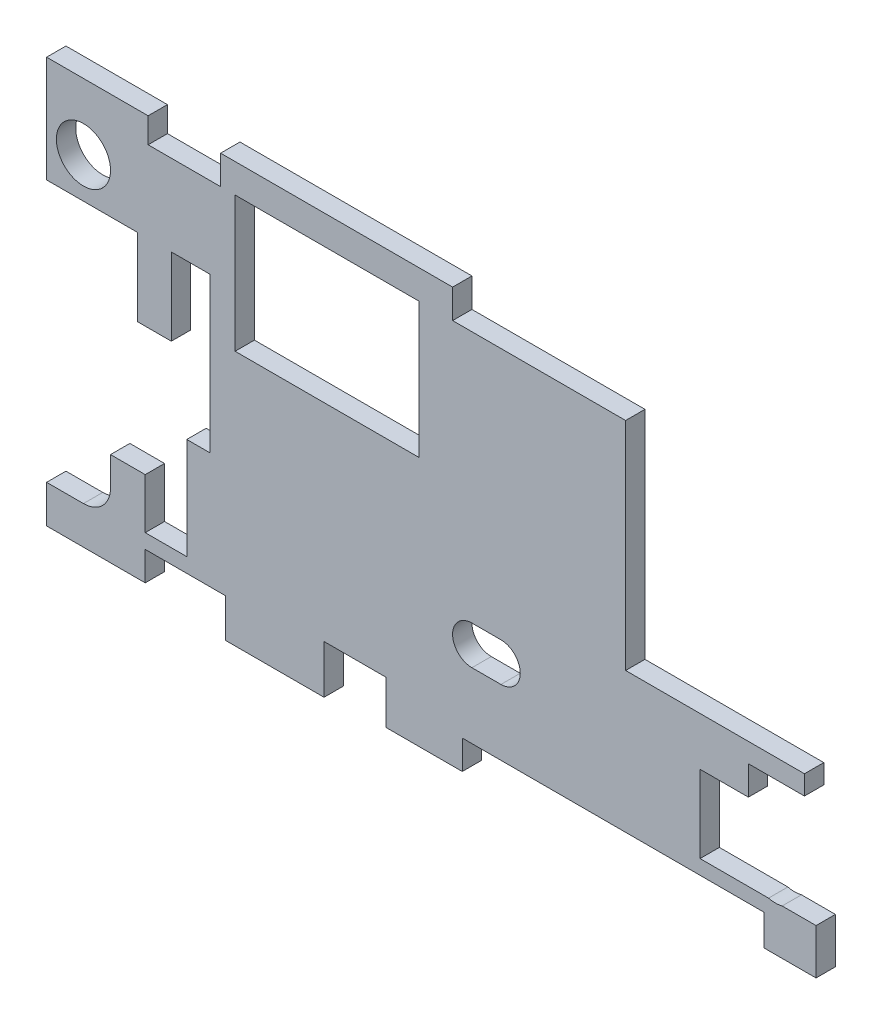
ISO-10303-21;
HEADER;
FILE_DESCRIPTION(('STEP AP214'),'2;1');
FILE_NAME('part.step','',(''),(''),'','','');
FILE_SCHEMA(('AUTOMOTIVE_DESIGN { 1 0 10303 214 1 1 1 1 }'));
ENDSEC;
DATA;
#1=APPLICATION_CONTEXT('core data for automotive mechanical design processes');
#2=APPLICATION_PROTOCOL_DEFINITION('international standard','automotive_design',2000,#1);
#3=PRODUCT_CONTEXT('',#1,'mechanical');
#4=PRODUCT('Part','Part','',(#3));
#5=PRODUCT_RELATED_PRODUCT_CATEGORY('part','',(#4));
#6=PRODUCT_DEFINITION_FORMATION('','',#4);
#7=PRODUCT_DEFINITION_CONTEXT('part definition',#1,'design');
#8=PRODUCT_DEFINITION('design','',#6,#7);
#9=PRODUCT_DEFINITION_SHAPE('','',#8);
#10=(LENGTH_UNIT() NAMED_UNIT(*) SI_UNIT(.MILLI.,.METRE.));
#11=(NAMED_UNIT(*) PLANE_ANGLE_UNIT() SI_UNIT($,.RADIAN.));
#12=(NAMED_UNIT(*) SI_UNIT($,.STERADIAN.) SOLID_ANGLE_UNIT());
#13=UNCERTAINTY_MEASURE_WITH_UNIT(LENGTH_MEASURE(1.E-05),#10,'distance_accuracy_value','');
#14=(GEOMETRIC_REPRESENTATION_CONTEXT(3) GLOBAL_UNCERTAINTY_ASSIGNED_CONTEXT((#13)) GLOBAL_UNIT_ASSIGNED_CONTEXT((#10,
#11,#12)) REPRESENTATION_CONTEXT('',''));
#15=CARTESIAN_POINT('',(0.,0.,0.));
#16=DIRECTION('',(0.,0.,1.));
#17=DIRECTION('',(1.,0.,0.));
#18=AXIS2_PLACEMENT_3D('',#15,#16,#17);
#19=CARTESIAN_POINT('',(0.,0.,2.));
#20=DIRECTION('',(0.,0.,1.));
#21=DIRECTION('',(1.,0.,0.));
#22=AXIS2_PLACEMENT_3D('',#19,#20,#21);
#23=PLANE('',#22);
#24=DIRECTION('',(-1.,0.,0.));
#25=VECTOR('',#24,1.);
#26=CARTESIAN_POINT('',(0.,-18.5,2.));
#27=LINE('',#26,#25);
#28=CARTESIAN_POINT('',(31.65,-18.5,2.));
#29=VERTEX_POINT('',#28);
#30=CARTESIAN_POINT('',(0.449999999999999,-18.5,2.));
#31=VERTEX_POINT('',#30);
#32=EDGE_CURVE('E775',#29,#31,#27,.T.);
#33=ORIENTED_EDGE('',*,*,#32,.F.);
#34=DIRECTION('',(0.,1.,0.));
#35=VECTOR('',#34,1.);
#36=CARTESIAN_POINT('',(31.65,-21.7,2.));
#37=LINE('',#36,#35);
#38=CARTESIAN_POINT('',(31.65,-21.7,2.));
#39=VERTEX_POINT('',#38);
#40=EDGE_CURVE('E671',#39,#29,#37,.T.);
#41=ORIENTED_EDGE('',*,*,#40,.F.);
#42=DIRECTION('',(-1.,0.,0.));
#43=VECTOR('',#42,1.);
#44=CARTESIAN_POINT('',(0.,-21.7,2.));
#45=LINE('',#44,#43);
#46=CARTESIAN_POINT('',(37.05,-21.7,2.));
#47=VERTEX_POINT('',#46);
#48=EDGE_CURVE('E680',#47,#39,#45,.T.);
#49=ORIENTED_EDGE('',*,*,#48,.F.);
#50=DIRECTION('',(0.,-1.,0.));
#51=VECTOR('',#50,1.);
#52=CARTESIAN_POINT('',(37.05,0.,2.));
#53=LINE('',#52,#51);
#54=CARTESIAN_POINT('',(37.05,-17.,2.));
#55=VERTEX_POINT('',#54);
#56=EDGE_CURVE('E771',#55,#47,#53,.T.);
#57=ORIENTED_EDGE('',*,*,#56,.F.);
#58=DIRECTION('',(1.,0.,0.));
#59=VECTOR('',#58,1.);
#60=CARTESIAN_POINT('',(0.,-17.,2.));
#61=LINE('',#60,#59);
#62=CARTESIAN_POINT('',(33.5442016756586,-17.,2.));
#63=VERTEX_POINT('',#62);
#64=EDGE_CURVE('E767',#63,#55,#61,.T.);
#65=ORIENTED_EDGE('',*,*,#64,.F.);
#66=CARTESIAN_POINT('',(32.8400000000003,-14.29,2.));
#67=DIRECTION('',(0.,0.,1.));
#68=DIRECTION('',(1.,0.,0.));
#69=AXIS2_PLACEMENT_3D('',#66,#67,#68);
#70=CIRCLE('',#69,2.8);
#71=CARTESIAN_POINT('',(32.135798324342,-17.,2.));
#72=VERTEX_POINT('',#71);
#73=EDGE_CURVE('E919',#72,#63,#70,.T.);
#74=ORIENTED_EDGE('',*,*,#73,.F.);
#75=DIRECTION('',(1.,0.,0.));
#76=VECTOR('',#75,1.);
#77=CARTESIAN_POINT('',(0.,-17.,2.));
#78=LINE('',#77,#76);
#79=CARTESIAN_POINT('',(25.05,-17.,2.));
#80=VERTEX_POINT('',#79);
#81=EDGE_CURVE('E765',#80,#72,#78,.T.);
#82=ORIENTED_EDGE('',*,*,#81,.F.);
#83=DIRECTION('',(0.,-1.,0.));
#84=VECTOR('',#83,1.);
#85=CARTESIAN_POINT('',(25.05,0.,2.));
#86=LINE('',#85,#84);
#87=CARTESIAN_POINT('',(25.05,-9.,2.));
#88=VERTEX_POINT('',#87);
#89=EDGE_CURVE('E847',#88,#80,#86,.T.);
#90=ORIENTED_EDGE('',*,*,#89,.F.);
#91=DIRECTION('',(-1.,0.,0.));
#92=VECTOR('',#91,1.);
#93=CARTESIAN_POINT('',(0.,-9.,2.));
#94=LINE('',#93,#92);
#95=CARTESIAN_POINT('',(30.05,-9.,2.));
#96=VERTEX_POINT('',#95);
#97=EDGE_CURVE('E844',#96,#88,#94,.T.);
#98=ORIENTED_EDGE('',*,*,#97,.F.);
#99=DIRECTION('',(0.,-1.,0.));
#100=VECTOR('',#99,1.);
#101=CARTESIAN_POINT('',(30.05,0.,2.));
#102=LINE('',#101,#100);
#103=CARTESIAN_POINT('',(30.05,-6.,2.));
#104=VERTEX_POINT('',#103);
#105=EDGE_CURVE('E841',#104,#96,#102,.T.);
#106=ORIENTED_EDGE('',*,*,#105,.F.);
#107=DIRECTION('',(1.,0.,0.));
#108=VECTOR('',#107,1.);
#109=CARTESIAN_POINT('',(0.,-6.,2.));
#110=LINE('',#109,#108);
#111=CARTESIAN_POINT('',(35.85,-6.,2.));
#112=VERTEX_POINT('',#111);
#113=EDGE_CURVE('E838',#104,#112,#110,.T.);
#114=ORIENTED_EDGE('',*,*,#113,.T.);
#115=DIRECTION('',(0.,-1.,0.));
#116=VECTOR('',#115,1.);
#117=CARTESIAN_POINT('',(35.85,0.,2.));
#118=LINE('',#117,#116);
#119=CARTESIAN_POINT('',(35.85,-4.,2.));
#120=VERTEX_POINT('',#119);
#121=EDGE_CURVE('E835',#120,#112,#118,.T.);
#122=ORIENTED_EDGE('',*,*,#121,.F.);
#123=DIRECTION('',(1.,0.,0.));
#124=VECTOR('',#123,1.);
#125=CARTESIAN_POINT('',(0.,-4.,2.));
#126=LINE('',#125,#124);
#127=CARTESIAN_POINT('',(17.35,-4.,2.));
#128=VERTEX_POINT('',#127);
#129=EDGE_CURVE('E832',#128,#120,#126,.T.);
#130=ORIENTED_EDGE('',*,*,#129,.F.);
#131=DIRECTION('',(0.,-1.,0.));
#132=VECTOR('',#131,1.);
#133=CARTESIAN_POINT('',(17.35,0.,2.));
#134=LINE('',#133,#132);
#135=CARTESIAN_POINT('',(17.35,18.4,2.));
#136=VERTEX_POINT('',#135);
#137=EDGE_CURVE('E829',#136,#128,#134,.T.);
#138=ORIENTED_EDGE('',*,*,#137,.F.);
#139=DIRECTION('',(1.,0.,0.));
#140=VECTOR('',#139,1.);
#141=CARTESIAN_POINT('',(0.,18.4,2.));
#142=LINE('',#141,#140);
#143=CARTESIAN_POINT('',(-0.550000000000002,18.4,2.));
#144=VERTEX_POINT('',#143);
#145=EDGE_CURVE('E826',#144,#136,#142,.T.);
#146=ORIENTED_EDGE('',*,*,#145,.F.);
#147=DIRECTION('',(0.,-1.,0.));
#148=VECTOR('',#147,1.);
#149=CARTESIAN_POINT('',(-0.549999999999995,0.,2.));
#150=LINE('',#149,#148);
#151=CARTESIAN_POINT('',(-0.550000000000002,21.4,2.));
#152=VERTEX_POINT('',#151);
#153=EDGE_CURVE('E823',#152,#144,#150,.T.);
#154=ORIENTED_EDGE('',*,*,#153,.F.);
#155=DIRECTION('',(1.,0.,0.));
#156=VECTOR('',#155,1.);
#157=CARTESIAN_POINT('',(0.,21.4,2.));
#158=LINE('',#157,#156);
#159=CARTESIAN_POINT('',(-24.55,21.4,2.));
#160=VERTEX_POINT('',#159);
#161=EDGE_CURVE('E820',#160,#152,#158,.T.);
#162=ORIENTED_EDGE('',*,*,#161,.F.);
#163=DIRECTION('',(0.,-1.,0.));
#164=VECTOR('',#163,1.);
#165=CARTESIAN_POINT('',(-24.55,0.,2.));
#166=LINE('',#165,#164);
#167=CARTESIAN_POINT('',(-24.55,18.4,2.));
#168=VERTEX_POINT('',#167);
#169=EDGE_CURVE('E817',#160,#168,#166,.T.);
#170=ORIENTED_EDGE('',*,*,#169,.T.);
#171=DIRECTION('',(1.,0.,0.));
#172=VECTOR('',#171,1.);
#173=CARTESIAN_POINT('',(0.,18.4,2.));
#174=LINE('',#173,#172);
#175=CARTESIAN_POINT('',(-32.05,18.4,2.));
#176=VERTEX_POINT('',#175);
#177=EDGE_CURVE('E814',#176,#168,#174,.T.);
#178=ORIENTED_EDGE('',*,*,#177,.F.);
#179=DIRECTION('',(0.,-1.,0.));
#180=VECTOR('',#179,1.);
#181=CARTESIAN_POINT('',(-32.05,0.,2.));
#182=LINE('',#181,#180);
#183=CARTESIAN_POINT('',(-32.05,21.,2.));
#184=VERTEX_POINT('',#183);
#185=EDGE_CURVE('E811',#184,#176,#182,.T.);
#186=ORIENTED_EDGE('',*,*,#185,.F.);
#187=DIRECTION('',(1.,0.,0.));
#188=VECTOR('',#187,1.);
#189=CARTESIAN_POINT('',(0.,21.,2.));
#190=LINE('',#189,#188);
#191=CARTESIAN_POINT('',(-42.55,21.,2.));
#192=VERTEX_POINT('',#191);
#193=EDGE_CURVE('E808',#192,#184,#190,.T.);
#194=ORIENTED_EDGE('',*,*,#193,.F.);
#195=DIRECTION('',(0.,-1.,0.));
#196=VECTOR('',#195,1.);
#197=CARTESIAN_POINT('',(-42.55,27.5,2.));
#198=LINE('',#197,#196);
#199=CARTESIAN_POINT('',(-42.55,10.,2.));
#200=VERTEX_POINT('',#199);
#201=EDGE_CURVE('E12',#192,#200,#198,.T.);
#202=ORIENTED_EDGE('',*,*,#201,.T.);
#203=DIRECTION('',(-1.,0.,0.));
#204=VECTOR('',#203,1.);
#205=CARTESIAN_POINT('',(0.,10.,2.));
#206=LINE('',#205,#204);
#207=CARTESIAN_POINT('',(-33.15,10.,2.));
#208=VERTEX_POINT('',#207);
#209=EDGE_CURVE('E1065',#208,#200,#206,.T.);
#210=ORIENTED_EDGE('',*,*,#209,.F.);
#211=DIRECTION('',(0.,-1.,0.));
#212=VECTOR('',#211,1.);
#213=CARTESIAN_POINT('',(-33.15,0.,2.));
#214=LINE('',#213,#212);
#215=CARTESIAN_POINT('',(-33.15,2.,2.));
#216=VERTEX_POINT('',#215);
#217=EDGE_CURVE('E1062',#208,#216,#214,.T.);
#218=ORIENTED_EDGE('',*,*,#217,.T.);
#219=DIRECTION('',(1.,0.,0.));
#220=VECTOR('',#219,1.);
#221=CARTESIAN_POINT('',(0.,2.,2.));
#222=LINE('',#221,#220);
#223=CARTESIAN_POINT('',(-29.65,2.,2.));
#224=VERTEX_POINT('',#223);
#225=EDGE_CURVE('E1059',#216,#224,#222,.T.);
#226=ORIENTED_EDGE('',*,*,#225,.T.);
#227=DIRECTION('',(0.,-1.,0.));
#228=VECTOR('',#227,1.);
#229=CARTESIAN_POINT('',(-29.65,0.,2.));
#230=LINE('',#229,#228);
#231=CARTESIAN_POINT('',(-29.65,10.,2.));
#232=VERTEX_POINT('',#231);
#233=EDGE_CURVE('E1056',#232,#224,#230,.T.);
#234=ORIENTED_EDGE('',*,*,#233,.F.);
#235=DIRECTION('',(-1.,0.,0.));
#236=VECTOR('',#235,1.);
#237=CARTESIAN_POINT('',(0.,10.,2.));
#238=LINE('',#237,#236);
#239=CARTESIAN_POINT('',(-25.65,10.,2.));
#240=VERTEX_POINT('',#239);
#241=EDGE_CURVE('E1053',#240,#232,#238,.T.);
#242=ORIENTED_EDGE('',*,*,#241,.F.);
#243=DIRECTION('',(0.,1.,0.));
#244=VECTOR('',#243,1.);
#245=CARTESIAN_POINT('',(-25.65,0.,2.));
#246=LINE('',#245,#244);
#247=CARTESIAN_POINT('',(-25.65,-6.,2.));
#248=VERTEX_POINT('',#247);
#249=EDGE_CURVE('E1050',#248,#240,#246,.T.);
#250=ORIENTED_EDGE('',*,*,#249,.F.);
#251=DIRECTION('',(1.,0.,0.));
#252=VECTOR('',#251,1.);
#253=CARTESIAN_POINT('',(0.,-6.,2.));
#254=LINE('',#253,#252);
#255=CARTESIAN_POINT('',(-28.05,-6.,2.));
#256=VERTEX_POINT('',#255);
#257=EDGE_CURVE('E1047',#256,#248,#254,.T.);
#258=ORIENTED_EDGE('',*,*,#257,.F.);
#259=DIRECTION('',(0.,1.,0.));
#260=VECTOR('',#259,1.);
#261=CARTESIAN_POINT('',(-28.05,0.,2.));
#262=LINE('',#261,#260);
#263=CARTESIAN_POINT('',(-28.05,-16.5,2.));
#264=VERTEX_POINT('',#263);
#265=EDGE_CURVE('E1044',#264,#256,#262,.T.);
#266=ORIENTED_EDGE('',*,*,#265,.F.);
#267=DIRECTION('',(1.,0.,0.));
#268=VECTOR('',#267,1.);
#269=CARTESIAN_POINT('',(0.,-16.5,2.));
#270=LINE('',#269,#268);
#271=CARTESIAN_POINT('',(-32.35,-16.5,2.));
#272=VERTEX_POINT('',#271);
#273=EDGE_CURVE('E1041',#272,#264,#270,.T.);
#274=ORIENTED_EDGE('',*,*,#273,.F.);
#275=DIRECTION('',(0.,-1.,0.));
#276=VECTOR('',#275,1.);
#277=CARTESIAN_POINT('',(-32.35,0.,2.));
#278=LINE('',#277,#276);
#279=CARTESIAN_POINT('',(-32.35,-11.3,2.));
#280=VERTEX_POINT('',#279);
#281=EDGE_CURVE('E1038',#280,#272,#278,.T.);
#282=ORIENTED_EDGE('',*,*,#281,.F.);
#283=DIRECTION('',(1.,0.,0.));
#284=VECTOR('',#283,1.);
#285=CARTESIAN_POINT('',(0.,-11.3,2.));
#286=LINE('',#285,#284);
#287=CARTESIAN_POINT('',(-35.9399999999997,-11.3,2.));
#288=VERTEX_POINT('',#287);
#289=EDGE_CURVE('E1035',#288,#280,#286,.T.);
#290=ORIENTED_EDGE('',*,*,#289,.F.);
#291=DIRECTION('',(0.,1.,0.));
#292=VECTOR('',#291,1.);
#293=CARTESIAN_POINT('',(-35.9399999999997,0.,2.));
#294=LINE('',#293,#292);
#295=CARTESIAN_POINT('',(-35.9399999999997,-14.29,2.));
#296=VERTEX_POINT('',#295);
#297=EDGE_CURVE('E1032',#296,#288,#294,.T.);
#298=ORIENTED_EDGE('',*,*,#297,.F.);
#299=CARTESIAN_POINT('',(-38.7399999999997,-14.29,2.));
#300=DIRECTION('',(0.,0.,1.));
#301=DIRECTION('',(1.,0.,0.));
#302=AXIS2_PLACEMENT_3D('',#299,#300,#301);
#303=CIRCLE('',#302,2.8);
#304=CARTESIAN_POINT('',(-38.7399999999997,-17.09,2.));
#305=VERTEX_POINT('',#304);
#306=EDGE_CURVE('E913',#305,#296,#303,.T.);
#307=ORIENTED_EDGE('',*,*,#306,.F.);
#308=DIRECTION('',(-1.,0.,0.));
#309=VECTOR('',#308,1.);
#310=CARTESIAN_POINT('',(0.,-17.09,2.));
#311=LINE('',#310,#309);
#312=CARTESIAN_POINT('',(-42.55,-17.09,2.));
#313=VERTEX_POINT('',#312);
#314=EDGE_CURVE('E998',#305,#313,#311,.T.);
#315=ORIENTED_EDGE('',*,*,#314,.T.);
#316=CARTESIAN_POINT('',(-42.55,-21.,2.));
#317=VERTEX_POINT('',#316);
#318=EDGE_CURVE('E320',#313,#317,#198,.T.);
#319=ORIENTED_EDGE('',*,*,#318,.T.);
#320=DIRECTION('',(-1.,0.,0.));
#321=VECTOR('',#320,1.);
#322=CARTESIAN_POINT('',(0.,-21.,2.));
#323=LINE('',#322,#321);
#324=CARTESIAN_POINT('',(-32.35,-21.,2.));
#325=VERTEX_POINT('',#324);
#326=EDGE_CURVE('E805',#325,#317,#323,.T.);
#327=ORIENTED_EDGE('',*,*,#326,.F.);
#328=DIRECTION('',(0.,-1.,0.));
#329=VECTOR('',#328,1.);
#330=CARTESIAN_POINT('',(-32.35,0.,2.));
#331=LINE('',#330,#329);
#332=CARTESIAN_POINT('',(-32.35,-18.,2.));
#333=VERTEX_POINT('',#332);
#334=EDGE_CURVE('E802',#333,#325,#331,.T.);
#335=ORIENTED_EDGE('',*,*,#334,.F.);
#336=DIRECTION('',(-1.,0.,0.));
#337=VECTOR('',#336,1.);
#338=CARTESIAN_POINT('',(0.,-18.,2.));
#339=LINE('',#338,#337);
#340=CARTESIAN_POINT('',(-24.05,-18.,2.));
#341=VERTEX_POINT('',#340);
#342=EDGE_CURVE('E799',#341,#333,#339,.T.);
#343=ORIENTED_EDGE('',*,*,#342,.F.);
#344=DIRECTION('',(0.,1.,0.));
#345=VECTOR('',#344,1.);
#346=CARTESIAN_POINT('',(-24.05,0.,2.));
#347=LINE('',#346,#345);
#348=CARTESIAN_POINT('',(-24.05,-22.,2.));
#349=VERTEX_POINT('',#348);
#350=EDGE_CURVE('E796',#349,#341,#347,.T.);
#351=ORIENTED_EDGE('',*,*,#350,.F.);
#352=DIRECTION('',(-1.,0.,0.));
#353=VECTOR('',#352,1.);
#354=CARTESIAN_POINT('',(0.,-22.,2.));
#355=LINE('',#354,#353);
#356=CARTESIAN_POINT('',(-13.85,-22.,2.));
#357=VERTEX_POINT('',#356);
#358=EDGE_CURVE('E793',#357,#349,#355,.T.);
#359=ORIENTED_EDGE('',*,*,#358,.F.);
#360=DIRECTION('',(0.,-1.,0.));
#361=VECTOR('',#360,1.);
#362=CARTESIAN_POINT('',(-13.85,0.,2.));
#363=LINE('',#362,#361);
#364=CARTESIAN_POINT('',(-13.85,-17.,2.));
#365=VERTEX_POINT('',#364);
#366=EDGE_CURVE('E790',#365,#357,#363,.T.);
#367=ORIENTED_EDGE('',*,*,#366,.F.);
#368=DIRECTION('',(-1.,0.,0.));
#369=VECTOR('',#368,1.);
#370=CARTESIAN_POINT('',(0.,-17.,2.));
#371=LINE('',#370,#369);
#372=CARTESIAN_POINT('',(-7.45000000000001,-17.,2.));
#373=VERTEX_POINT('',#372);
#374=EDGE_CURVE('E787',#373,#365,#371,.T.);
#375=ORIENTED_EDGE('',*,*,#374,.F.);
#376=DIRECTION('',(0.,1.,0.));
#377=VECTOR('',#376,1.);
#378=CARTESIAN_POINT('',(-7.45000000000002,0.,2.));
#379=LINE('',#378,#377);
#380=CARTESIAN_POINT('',(-7.45000000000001,-21.5,2.));
#381=VERTEX_POINT('',#380);
#382=EDGE_CURVE('E784',#381,#373,#379,.T.);
#383=ORIENTED_EDGE('',*,*,#382,.F.);
#384=DIRECTION('',(-1.,0.,0.));
#385=VECTOR('',#384,1.);
#386=CARTESIAN_POINT('',(0.,-21.5,2.));
#387=LINE('',#386,#385);
#388=CARTESIAN_POINT('',(0.449999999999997,-21.5,2.));
#389=VERTEX_POINT('',#388);
#390=EDGE_CURVE('E781',#389,#381,#387,.T.);
#391=ORIENTED_EDGE('',*,*,#390,.F.);
#392=DIRECTION('',(0.,-1.,0.));
#393=VECTOR('',#392,1.);
#394=CARTESIAN_POINT('',(0.450000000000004,0.,2.));
#395=LINE('',#394,#393);
#396=EDGE_CURVE('E778',#31,#389,#395,.T.);
#397=ORIENTED_EDGE('',*,*,#396,.F.);
#398=EDGE_LOOP('',(#33,#41,#49,#57,#65,#74,#82,#90,#98,#106,#114,#122,#130,#138,#146,#154,#162,
#170,#178,#186,#194,#202,#210,#218,#226,#234,#242,#250,#258,#266,#274,#282,#290,#298,#307,#315,
#319,#327,#335,#343,#351,#359,#367,#375,#383,#391,#397));
#399=FACE_BOUND('',#398,.T.);
#400=CARTESIAN_POINT('',(1.45000000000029,-9.69999999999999,2.));
#401=DIRECTION('',(0.,0.,1.));
#402=DIRECTION('',(1.,0.,0.));
#403=AXIS2_PLACEMENT_3D('',#400,#401,#402);
#404=CIRCLE('',#403,2.);
#405=CARTESIAN_POINT('',(1.45000000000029,-7.69999999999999,2.));
#406=VERTEX_POINT('',#405);
#407=CARTESIAN_POINT('',(1.45000000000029,-11.7,2.));
#408=VERTEX_POINT('',#407);
#409=EDGE_CURVE('E961',#406,#408,#404,.T.);
#410=ORIENTED_EDGE('',*,*,#409,.F.);
#411=DIRECTION('',(-1.,0.,0.));
#412=VECTOR('',#411,1.);
#413=CARTESIAN_POINT('',(0.,-7.69999999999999,2.));
#414=LINE('',#413,#412);
#415=CARTESIAN_POINT('',(4.45000000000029,-7.69999999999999,2.));
#416=VERTEX_POINT('',#415);
#417=EDGE_CURVE('E1336',#416,#406,#414,.T.);
#418=ORIENTED_EDGE('',*,*,#417,.F.);
#419=CARTESIAN_POINT('',(4.45000000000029,-9.69999999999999,2.));
#420=DIRECTION('',(0.,0.,1.));
#421=DIRECTION('',(1.,0.,0.));
#422=AXIS2_PLACEMENT_3D('',#419,#420,#421);
#423=CIRCLE('',#422,2.);
#424=CARTESIAN_POINT('',(4.45000000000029,-11.7,2.));
#425=VERTEX_POINT('',#424);
#426=EDGE_CURVE('E1334',#425,#416,#423,.T.);
#427=ORIENTED_EDGE('',*,*,#426,.F.);
#428=DIRECTION('',(1.,0.,0.));
#429=VECTOR('',#428,1.);
#430=CARTESIAN_POINT('',(0.,-11.7,2.));
#431=LINE('',#430,#429);
#432=EDGE_CURVE('E1326',#408,#425,#431,.T.);
#433=ORIENTED_EDGE('',*,*,#432,.F.);
#434=EDGE_LOOP('',(#410,#418,#427,#433));
#435=FACE_BOUND('',#434,.T.);
#436=CARTESIAN_POINT('',(-38.74,14.16,2.));
#437=DIRECTION('',(0.,0.,1.));
#438=DIRECTION('',(1.,0.,0.));
#439=AXIS2_PLACEMENT_3D('',#436,#437,#438);
#440=CIRCLE('',#439,2.8);
#441=CARTESIAN_POINT('',(-35.94,14.16,2.));
#442=VERTEX_POINT('',#441);
#443=EDGE_CURVE('E925',#442,#442,#440,.T.);
#444=ORIENTED_EDGE('',*,*,#443,.F.);
#445=EDGE_LOOP('',(#444));
#446=FACE_BOUND('',#445,.T.);
#447=DIRECTION('',(0.,-1.,0.));
#448=VECTOR('',#447,1.);
#449=CARTESIAN_POINT('',(-23.05,0.,2.));
#450=LINE('',#449,#448);
#451=CARTESIAN_POINT('',(-23.05,18.4,2.));
#452=VERTEX_POINT('',#451);
#453=CARTESIAN_POINT('',(-23.05,4.4,2.));
#454=VERTEX_POINT('',#453);
#455=EDGE_CURVE('E968',#452,#454,#450,.T.);
#456=ORIENTED_EDGE('',*,*,#455,.F.);
#457=DIRECTION('',(1.,0.,0.));
#458=VECTOR('',#457,1.);
#459=CARTESIAN_POINT('',(0.,18.4,2.));
#460=LINE('',#459,#458);
#461=CARTESIAN_POINT('',(-4.05000000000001,18.4,2.));
#462=VERTEX_POINT('',#461);
#463=EDGE_CURVE('E970',#452,#462,#460,.T.);
#464=ORIENTED_EDGE('',*,*,#463,.T.);
#465=DIRECTION('',(0.,-1.,0.));
#466=VECTOR('',#465,1.);
#467=CARTESIAN_POINT('',(-4.05000000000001,0.,2.));
#468=LINE('',#467,#466);
#469=CARTESIAN_POINT('',(-4.05000000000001,4.4,2.));
#470=VERTEX_POINT('',#469);
#471=EDGE_CURVE('E977',#462,#470,#468,.T.);
#472=ORIENTED_EDGE('',*,*,#471,.T.);
#473=DIRECTION('',(1.,0.,0.));
#474=VECTOR('',#473,1.);
#475=CARTESIAN_POINT('',(0.,4.4,2.));
#476=LINE('',#475,#474);
#477=EDGE_CURVE('E972',#454,#470,#476,.T.);
#478=ORIENTED_EDGE('',*,*,#477,.F.);
#479=EDGE_LOOP('',(#456,#464,#472,#478));
#480=FACE_BOUND('',#479,.T.);
#481=ADVANCED_FACE('F311',(#399,#435,#446,#480),#23,.T.);
#482=CARTESIAN_POINT('',(0.,0.,0.));
#483=DIRECTION('',(0.,0.,1.));
#484=DIRECTION('',(1.,0.,0.));
#485=AXIS2_PLACEMENT_3D('',#482,#483,#484);
#486=PLANE('',#485);
#487=DIRECTION('',(-1.,0.,0.));
#488=VECTOR('',#487,1.);
#489=CARTESIAN_POINT('',(1.45000000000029,-7.69999999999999,0.));
#490=LINE('',#489,#488);
#491=CARTESIAN_POINT('',(4.45000000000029,-7.69999999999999,0.));
#492=VERTEX_POINT('',#491);
#493=CARTESIAN_POINT('',(1.45000000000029,-7.69999999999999,0.));
#494=VERTEX_POINT('',#493);
#495=EDGE_CURVE('E1320',#492,#494,#490,.T.);
#496=ORIENTED_EDGE('',*,*,#495,.T.);
#497=CARTESIAN_POINT('',(1.45000000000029,-9.69999999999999,0.));
#498=DIRECTION('',(0.,0.,1.));
#499=DIRECTION('',(1.,0.,0.));
#500=AXIS2_PLACEMENT_3D('',#497,#498,#499);
#501=CIRCLE('',#500,2.);
#502=CARTESIAN_POINT('',(1.45000000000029,-11.7,0.));
#503=VERTEX_POINT('',#502);
#504=EDGE_CURVE('E1310',#494,#503,#501,.T.);
#505=ORIENTED_EDGE('',*,*,#504,.T.);
#506=DIRECTION('',(1.,0.,0.));
#507=VECTOR('',#506,1.);
#508=CARTESIAN_POINT('',(1.45000000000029,-11.7,0.));
#509=LINE('',#508,#507);
#510=CARTESIAN_POINT('',(4.45000000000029,-11.7,0.));
#511=VERTEX_POINT('',#510);
#512=EDGE_CURVE('E1316',#503,#511,#509,.T.);
#513=ORIENTED_EDGE('',*,*,#512,.T.);
#514=CARTESIAN_POINT('',(4.45000000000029,-9.69999999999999,0.));
#515=DIRECTION('',(0.,0.,1.));
#516=DIRECTION('',(1.,0.,0.));
#517=AXIS2_PLACEMENT_3D('',#514,#515,#516);
#518=CIRCLE('',#517,2.);
#519=EDGE_CURVE('E335',#511,#492,#518,.T.);
#520=ORIENTED_EDGE('',*,*,#519,.T.);
#521=EDGE_LOOP('',(#496,#505,#513,#520));
#522=FACE_BOUND('',#521,.T.);
#523=DIRECTION('',(0.,1.,0.));
#524=VECTOR('',#523,1.);
#525=CARTESIAN_POINT('',(31.65,-21.7,0.));
#526=LINE('',#525,#524);
#527=CARTESIAN_POINT('',(31.65,-21.7,0.));
#528=VERTEX_POINT('',#527);
#529=CARTESIAN_POINT('',(31.65,-18.5,0.));
#530=VERTEX_POINT('',#529);
#531=EDGE_CURVE('E660',#528,#530,#526,.T.);
#532=ORIENTED_EDGE('',*,*,#531,.T.);
#533=DIRECTION('',(-1.,0.,0.));
#534=VECTOR('',#533,1.);
#535=CARTESIAN_POINT('',(0.,-18.5,0.));
#536=LINE('',#535,#534);
#537=CARTESIAN_POINT('',(0.449999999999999,-18.5,0.));
#538=VERTEX_POINT('',#537);
#539=EDGE_CURVE('E687',#530,#538,#536,.T.);
#540=ORIENTED_EDGE('',*,*,#539,.T.);
#541=DIRECTION('',(0.,-1.,0.));
#542=VECTOR('',#541,1.);
#543=CARTESIAN_POINT('',(0.450000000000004,0.,0.));
#544=LINE('',#543,#542);
#545=CARTESIAN_POINT('',(0.449999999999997,-21.5,0.));
#546=VERTEX_POINT('',#545);
#547=EDGE_CURVE('E689',#538,#546,#544,.T.);
#548=ORIENTED_EDGE('',*,*,#547,.T.);
#549=DIRECTION('',(-1.,0.,0.));
#550=VECTOR('',#549,1.);
#551=CARTESIAN_POINT('',(0.,-21.5,0.));
#552=LINE('',#551,#550);
#553=CARTESIAN_POINT('',(-7.45000000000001,-21.5,0.));
#554=VERTEX_POINT('',#553);
#555=EDGE_CURVE('E697',#546,#554,#552,.T.);
#556=ORIENTED_EDGE('',*,*,#555,.T.);
#557=DIRECTION('',(0.,1.,0.));
#558=VECTOR('',#557,1.);
#559=CARTESIAN_POINT('',(-7.45000000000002,0.,0.));
#560=LINE('',#559,#558);
#561=CARTESIAN_POINT('',(-7.45000000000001,-17.,0.));
#562=VERTEX_POINT('',#561);
#563=EDGE_CURVE('E700',#554,#562,#560,.T.);
#564=ORIENTED_EDGE('',*,*,#563,.T.);
#565=DIRECTION('',(-1.,0.,0.));
#566=VECTOR('',#565,1.);
#567=CARTESIAN_POINT('',(0.,-17.,0.));
#568=LINE('',#567,#566);
#569=CARTESIAN_POINT('',(-13.85,-17.,0.));
#570=VERTEX_POINT('',#569);
#571=EDGE_CURVE('E703',#562,#570,#568,.T.);
#572=ORIENTED_EDGE('',*,*,#571,.T.);
#573=DIRECTION('',(0.,-1.,0.));
#574=VECTOR('',#573,1.);
#575=CARTESIAN_POINT('',(-13.85,0.,0.));
#576=LINE('',#575,#574);
#577=CARTESIAN_POINT('',(-13.85,-22.,0.));
#578=VERTEX_POINT('',#577);
#579=EDGE_CURVE('E706',#570,#578,#576,.T.);
#580=ORIENTED_EDGE('',*,*,#579,.T.);
#581=DIRECTION('',(-1.,0.,0.));
#582=VECTOR('',#581,1.);
#583=CARTESIAN_POINT('',(0.,-22.,0.));
#584=LINE('',#583,#582);
#585=CARTESIAN_POINT('',(-24.05,-22.,0.));
#586=VERTEX_POINT('',#585);
#587=EDGE_CURVE('E709',#578,#586,#584,.T.);
#588=ORIENTED_EDGE('',*,*,#587,.T.);
#589=DIRECTION('',(0.,1.,0.));
#590=VECTOR('',#589,1.);
#591=CARTESIAN_POINT('',(-24.05,0.,0.));
#592=LINE('',#591,#590);
#593=CARTESIAN_POINT('',(-24.05,-18.,0.));
#594=VERTEX_POINT('',#593);
#595=EDGE_CURVE('E712',#586,#594,#592,.T.);
#596=ORIENTED_EDGE('',*,*,#595,.T.);
#597=DIRECTION('',(-1.,0.,0.));
#598=VECTOR('',#597,1.);
#599=CARTESIAN_POINT('',(0.,-18.,0.));
#600=LINE('',#599,#598);
#601=CARTESIAN_POINT('',(-32.35,-18.,0.));
#602=VERTEX_POINT('',#601);
#603=EDGE_CURVE('E715',#594,#602,#600,.T.);
#604=ORIENTED_EDGE('',*,*,#603,.T.);
#605=DIRECTION('',(0.,-1.,0.));
#606=VECTOR('',#605,1.);
#607=CARTESIAN_POINT('',(-32.35,0.,0.));
#608=LINE('',#607,#606);
#609=CARTESIAN_POINT('',(-32.35,-21.,0.));
#610=VERTEX_POINT('',#609);
#611=EDGE_CURVE('E718',#602,#610,#608,.T.);
#612=ORIENTED_EDGE('',*,*,#611,.T.);
#613=DIRECTION('',(-1.,0.,0.));
#614=VECTOR('',#613,1.);
#615=CARTESIAN_POINT('',(0.,-21.,0.));
#616=LINE('',#615,#614);
#617=CARTESIAN_POINT('',(-42.55,-21.,0.));
#618=VERTEX_POINT('',#617);
#619=EDGE_CURVE('E721',#610,#618,#616,.T.);
#620=ORIENTED_EDGE('',*,*,#619,.T.);
#621=DIRECTION('',(0.,-1.,0.));
#622=VECTOR('',#621,1.);
#623=CARTESIAN_POINT('',(-42.55,27.5,0.));
#624=LINE('',#623,#622);
#625=CARTESIAN_POINT('',(-42.55,-17.09,0.));
#626=VERTEX_POINT('',#625);
#627=EDGE_CURVE('E928',#626,#618,#624,.T.);
#628=ORIENTED_EDGE('',*,*,#627,.F.);
#629=DIRECTION('',(-1.,0.,0.));
#630=VECTOR('',#629,1.);
#631=CARTESIAN_POINT('',(0.,-17.09,0.));
#632=LINE('',#631,#630);
#633=CARTESIAN_POINT('',(-38.7399999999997,-17.09,0.));
#634=VERTEX_POINT('',#633);
#635=EDGE_CURVE('E1029',#634,#626,#632,.T.);
#636=ORIENTED_EDGE('',*,*,#635,.F.);
#637=CARTESIAN_POINT('',(-38.7399999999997,-14.29,0.));
#638=DIRECTION('',(0.,0.,1.));
#639=DIRECTION('',(1.,0.,0.));
#640=AXIS2_PLACEMENT_3D('',#637,#638,#639);
#641=CIRCLE('',#640,2.8);
#642=CARTESIAN_POINT('',(-35.9399999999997,-14.29,0.));
#643=VERTEX_POINT('',#642);
#644=EDGE_CURVE('E853',#634,#643,#641,.T.);
#645=ORIENTED_EDGE('',*,*,#644,.T.);
#646=DIRECTION('',(0.,1.,0.));
#647=VECTOR('',#646,1.);
#648=CARTESIAN_POINT('',(-35.9399999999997,0.,0.));
#649=LINE('',#648,#647);
#650=CARTESIAN_POINT('',(-35.9399999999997,-11.3,0.));
#651=VERTEX_POINT('',#650);
#652=EDGE_CURVE('E994',#643,#651,#649,.T.);
#653=ORIENTED_EDGE('',*,*,#652,.T.);
#654=DIRECTION('',(1.,0.,0.));
#655=VECTOR('',#654,1.);
#656=CARTESIAN_POINT('',(0.,-11.3,0.));
#657=LINE('',#656,#655);
#658=CARTESIAN_POINT('',(-32.35,-11.3,0.));
#659=VERTEX_POINT('',#658);
#660=EDGE_CURVE('E997',#651,#659,#657,.T.);
#661=ORIENTED_EDGE('',*,*,#660,.T.);
#662=DIRECTION('',(0.,-1.,0.));
#663=VECTOR('',#662,1.);
#664=CARTESIAN_POINT('',(-32.35,0.,0.));
#665=LINE('',#664,#663);
#666=CARTESIAN_POINT('',(-32.35,-16.5,0.));
#667=VERTEX_POINT('',#666);
#668=EDGE_CURVE('E1001',#659,#667,#665,.T.);
#669=ORIENTED_EDGE('',*,*,#668,.T.);
#670=DIRECTION('',(1.,0.,0.));
#671=VECTOR('',#670,1.);
#672=CARTESIAN_POINT('',(0.,-16.5,0.));
#673=LINE('',#672,#671);
#674=CARTESIAN_POINT('',(-28.05,-16.5,0.));
#675=VERTEX_POINT('',#674);
#676=EDGE_CURVE('E1004',#667,#675,#673,.T.);
#677=ORIENTED_EDGE('',*,*,#676,.T.);
#678=DIRECTION('',(0.,1.,0.));
#679=VECTOR('',#678,1.);
#680=CARTESIAN_POINT('',(-28.05,0.,0.));
#681=LINE('',#680,#679);
#682=CARTESIAN_POINT('',(-28.05,-6.,0.));
#683=VERTEX_POINT('',#682);
#684=EDGE_CURVE('E1007',#675,#683,#681,.T.);
#685=ORIENTED_EDGE('',*,*,#684,.T.);
#686=DIRECTION('',(1.,0.,0.));
#687=VECTOR('',#686,1.);
#688=CARTESIAN_POINT('',(0.,-6.,0.));
#689=LINE('',#688,#687);
#690=CARTESIAN_POINT('',(-25.65,-6.,0.));
#691=VERTEX_POINT('',#690);
#692=EDGE_CURVE('E1010',#683,#691,#689,.T.);
#693=ORIENTED_EDGE('',*,*,#692,.T.);
#694=DIRECTION('',(0.,1.,0.));
#695=VECTOR('',#694,1.);
#696=CARTESIAN_POINT('',(-25.65,0.,0.));
#697=LINE('',#696,#695);
#698=CARTESIAN_POINT('',(-25.65,10.,0.));
#699=VERTEX_POINT('',#698);
#700=EDGE_CURVE('E1013',#691,#699,#697,.T.);
#701=ORIENTED_EDGE('',*,*,#700,.T.);
#702=DIRECTION('',(-1.,0.,0.));
#703=VECTOR('',#702,1.);
#704=CARTESIAN_POINT('',(0.,10.,0.));
#705=LINE('',#704,#703);
#706=CARTESIAN_POINT('',(-29.65,10.,0.));
#707=VERTEX_POINT('',#706);
#708=EDGE_CURVE('E1016',#699,#707,#705,.T.);
#709=ORIENTED_EDGE('',*,*,#708,.T.);
#710=DIRECTION('',(0.,-1.,0.));
#711=VECTOR('',#710,1.);
#712=CARTESIAN_POINT('',(-29.65,0.,0.));
#713=LINE('',#712,#711);
#714=CARTESIAN_POINT('',(-29.65,2.,0.));
#715=VERTEX_POINT('',#714);
#716=EDGE_CURVE('E1019',#707,#715,#713,.T.);
#717=ORIENTED_EDGE('',*,*,#716,.T.);
#718=DIRECTION('',(1.,0.,0.));
#719=VECTOR('',#718,1.);
#720=CARTESIAN_POINT('',(0.,2.,0.));
#721=LINE('',#720,#719);
#722=CARTESIAN_POINT('',(-33.15,2.,0.));
#723=VERTEX_POINT('',#722);
#724=EDGE_CURVE('E1022',#723,#715,#721,.T.);
#725=ORIENTED_EDGE('',*,*,#724,.F.);
#726=DIRECTION('',(0.,-1.,0.));
#727=VECTOR('',#726,1.);
#728=CARTESIAN_POINT('',(-33.15,0.,0.));
#729=LINE('',#728,#727);
#730=CARTESIAN_POINT('',(-33.15,10.,0.));
#731=VERTEX_POINT('',#730);
#732=EDGE_CURVE('E1024',#731,#723,#729,.T.);
#733=ORIENTED_EDGE('',*,*,#732,.F.);
#734=DIRECTION('',(-1.,0.,0.));
#735=VECTOR('',#734,1.);
#736=CARTESIAN_POINT('',(0.,10.,0.));
#737=LINE('',#736,#735);
#738=CARTESIAN_POINT('',(-42.55,10.,0.));
#739=VERTEX_POINT('',#738);
#740=EDGE_CURVE('E1026',#731,#739,#737,.T.);
#741=ORIENTED_EDGE('',*,*,#740,.T.);
#742=CARTESIAN_POINT('',(-42.55,21.,0.));
#743=VERTEX_POINT('',#742);
#744=EDGE_CURVE('E315',#743,#739,#624,.T.);
#745=ORIENTED_EDGE('',*,*,#744,.F.);
#746=DIRECTION('',(1.,0.,0.));
#747=VECTOR('',#746,1.);
#748=CARTESIAN_POINT('',(0.,21.,0.));
#749=LINE('',#748,#747);
#750=CARTESIAN_POINT('',(-32.05,21.,0.));
#751=VERTEX_POINT('',#750);
#752=EDGE_CURVE('E724',#743,#751,#749,.T.);
#753=ORIENTED_EDGE('',*,*,#752,.T.);
#754=DIRECTION('',(0.,-1.,0.));
#755=VECTOR('',#754,1.);
#756=CARTESIAN_POINT('',(-32.05,0.,0.));
#757=LINE('',#756,#755);
#758=CARTESIAN_POINT('',(-32.05,18.4,0.));
#759=VERTEX_POINT('',#758);
#760=EDGE_CURVE('E727',#751,#759,#757,.T.);
#761=ORIENTED_EDGE('',*,*,#760,.T.);
#762=DIRECTION('',(1.,0.,0.));
#763=VECTOR('',#762,1.);
#764=CARTESIAN_POINT('',(0.,18.4,0.));
#765=LINE('',#764,#763);
#766=CARTESIAN_POINT('',(-24.55,18.4,0.));
#767=VERTEX_POINT('',#766);
#768=EDGE_CURVE('E730',#759,#767,#765,.T.);
#769=ORIENTED_EDGE('',*,*,#768,.T.);
#770=DIRECTION('',(0.,-1.,0.));
#771=VECTOR('',#770,1.);
#772=CARTESIAN_POINT('',(-24.55,0.,0.));
#773=LINE('',#772,#771);
#774=CARTESIAN_POINT('',(-24.55,21.4,0.));
#775=VERTEX_POINT('',#774);
#776=EDGE_CURVE('E733',#775,#767,#773,.T.);
#777=ORIENTED_EDGE('',*,*,#776,.F.);
#778=DIRECTION('',(1.,0.,0.));
#779=VECTOR('',#778,1.);
#780=CARTESIAN_POINT('',(0.,21.4,0.));
#781=LINE('',#780,#779);
#782=CARTESIAN_POINT('',(-0.550000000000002,21.4,0.));
#783=VERTEX_POINT('',#782);
#784=EDGE_CURVE('E735',#775,#783,#781,.T.);
#785=ORIENTED_EDGE('',*,*,#784,.T.);
#786=DIRECTION('',(0.,-1.,0.));
#787=VECTOR('',#786,1.);
#788=CARTESIAN_POINT('',(-0.549999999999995,0.,0.));
#789=LINE('',#788,#787);
#790=CARTESIAN_POINT('',(-0.550000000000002,18.4,0.));
#791=VERTEX_POINT('',#790);
#792=EDGE_CURVE('E738',#783,#791,#789,.T.);
#793=ORIENTED_EDGE('',*,*,#792,.T.);
#794=DIRECTION('',(1.,0.,0.));
#795=VECTOR('',#794,1.);
#796=CARTESIAN_POINT('',(0.,18.4,0.));
#797=LINE('',#796,#795);
#798=CARTESIAN_POINT('',(17.35,18.4,0.));
#799=VERTEX_POINT('',#798);
#800=EDGE_CURVE('E741',#791,#799,#797,.T.);
#801=ORIENTED_EDGE('',*,*,#800,.T.);
#802=DIRECTION('',(0.,-1.,0.));
#803=VECTOR('',#802,1.);
#804=CARTESIAN_POINT('',(17.35,0.,0.));
#805=LINE('',#804,#803);
#806=CARTESIAN_POINT('',(17.35,-4.,0.));
#807=VERTEX_POINT('',#806);
#808=EDGE_CURVE('E744',#799,#807,#805,.T.);
#809=ORIENTED_EDGE('',*,*,#808,.T.);
#810=DIRECTION('',(1.,0.,0.));
#811=VECTOR('',#810,1.);
#812=CARTESIAN_POINT('',(0.,-4.,0.));
#813=LINE('',#812,#811);
#814=CARTESIAN_POINT('',(35.85,-4.,0.));
#815=VERTEX_POINT('',#814);
#816=EDGE_CURVE('E747',#807,#815,#813,.T.);
#817=ORIENTED_EDGE('',*,*,#816,.T.);
#818=DIRECTION('',(0.,-1.,0.));
#819=VECTOR('',#818,1.);
#820=CARTESIAN_POINT('',(35.85,0.,0.));
#821=LINE('',#820,#819);
#822=CARTESIAN_POINT('',(35.85,-6.,0.));
#823=VERTEX_POINT('',#822);
#824=EDGE_CURVE('E750',#815,#823,#821,.T.);
#825=ORIENTED_EDGE('',*,*,#824,.T.);
#826=DIRECTION('',(1.,0.,0.));
#827=VECTOR('',#826,1.);
#828=CARTESIAN_POINT('',(0.,-6.,0.));
#829=LINE('',#828,#827);
#830=CARTESIAN_POINT('',(30.05,-6.,0.));
#831=VERTEX_POINT('',#830);
#832=EDGE_CURVE('E753',#831,#823,#829,.T.);
#833=ORIENTED_EDGE('',*,*,#832,.F.);
#834=DIRECTION('',(0.,-1.,0.));
#835=VECTOR('',#834,1.);
#836=CARTESIAN_POINT('',(30.05,0.,0.));
#837=LINE('',#836,#835);
#838=CARTESIAN_POINT('',(30.05,-9.,0.));
#839=VERTEX_POINT('',#838);
#840=EDGE_CURVE('E755',#831,#839,#837,.T.);
#841=ORIENTED_EDGE('',*,*,#840,.T.);
#842=DIRECTION('',(-1.,0.,0.));
#843=VECTOR('',#842,1.);
#844=CARTESIAN_POINT('',(0.,-9.,0.));
#845=LINE('',#844,#843);
#846=CARTESIAN_POINT('',(25.05,-9.,0.));
#847=VERTEX_POINT('',#846);
#848=EDGE_CURVE('E758',#839,#847,#845,.T.);
#849=ORIENTED_EDGE('',*,*,#848,.T.);
#850=DIRECTION('',(0.,-1.,0.));
#851=VECTOR('',#850,1.);
#852=CARTESIAN_POINT('',(25.05,0.,0.));
#853=LINE('',#852,#851);
#854=CARTESIAN_POINT('',(25.05,-17.,0.));
#855=VERTEX_POINT('',#854);
#856=EDGE_CURVE('E761',#847,#855,#853,.T.);
#857=ORIENTED_EDGE('',*,*,#856,.T.);
#858=DIRECTION('',(1.,0.,0.));
#859=VECTOR('',#858,1.);
#860=CARTESIAN_POINT('',(0.,-17.,0.));
#861=LINE('',#860,#859);
#862=CARTESIAN_POINT('',(32.135798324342,-17.,0.));
#863=VERTEX_POINT('',#862);
#864=EDGE_CURVE('E850',#855,#863,#861,.T.);
#865=ORIENTED_EDGE('',*,*,#864,.T.);
#866=CARTESIAN_POINT('',(32.8400000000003,-14.29,0.));
#867=DIRECTION('',(0.,0.,1.));
#868=DIRECTION('',(1.,0.,0.));
#869=AXIS2_PLACEMENT_3D('',#866,#867,#868);
#870=CIRCLE('',#869,2.8);
#871=CARTESIAN_POINT('',(33.5442016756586,-17.,0.));
#872=VERTEX_POINT('',#871);
#873=EDGE_CURVE('E916',#863,#872,#870,.T.);
#874=ORIENTED_EDGE('',*,*,#873,.T.);
#875=DIRECTION('',(1.,0.,0.));
#876=VECTOR('',#875,1.);
#877=CARTESIAN_POINT('',(0.,-17.,0.));
#878=LINE('',#877,#876);
#879=CARTESIAN_POINT('',(37.05,-17.,0.));
#880=VERTEX_POINT('',#879);
#881=EDGE_CURVE('E691',#872,#880,#878,.T.);
#882=ORIENTED_EDGE('',*,*,#881,.T.);
#883=DIRECTION('',(0.,-1.,0.));
#884=VECTOR('',#883,1.);
#885=CARTESIAN_POINT('',(37.05,0.,0.));
#886=LINE('',#885,#884);
#887=CARTESIAN_POINT('',(37.05,-21.7,0.));
#888=VERTEX_POINT('',#887);
#889=EDGE_CURVE('E686',#880,#888,#886,.T.);
#890=ORIENTED_EDGE('',*,*,#889,.T.);
#891=DIRECTION('',(-1.,0.,0.));
#892=VECTOR('',#891,1.);
#893=CARTESIAN_POINT('',(0.,-21.7,0.));
#894=LINE('',#893,#892);
#895=EDGE_CURVE('E677',#888,#528,#894,.T.);
#896=ORIENTED_EDGE('',*,*,#895,.T.);
#897=EDGE_LOOP('',(#532,#540,#548,#556,#564,#572,#580,#588,#596,#604,#612,#620,#628,#636,#645,
#653,#661,#669,#677,#685,#693,#701,#709,#717,#725,#733,#741,#745,#753,#761,#769,#777,#785,#793,
#801,#809,#817,#825,#833,#841,#849,#857,#865,#874,#882,#890,#896));
#898=FACE_BOUND('',#897,.T.);
#899=CARTESIAN_POINT('',(-38.74,14.16,0.));
#900=DIRECTION('',(0.,0.,1.));
#901=DIRECTION('',(1.,0.,0.));
#902=AXIS2_PLACEMENT_3D('',#899,#900,#901);
#903=CIRCLE('',#902,2.8);
#904=CARTESIAN_POINT('',(-35.94,14.16,0.));
#905=VERTEX_POINT('',#904);
#906=EDGE_CURVE('E922',#905,#905,#903,.T.);
#907=ORIENTED_EDGE('',*,*,#906,.T.);
#908=EDGE_LOOP('',(#907));
#909=FACE_BOUND('',#908,.T.);
#910=DIRECTION('',(1.,0.,0.));
#911=VECTOR('',#910,1.);
#912=CARTESIAN_POINT('',(0.,18.4,0.));
#913=LINE('',#912,#911);
#914=CARTESIAN_POINT('',(-23.05,18.4,0.));
#915=VERTEX_POINT('',#914);
#916=CARTESIAN_POINT('',(-4.05000000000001,18.4,0.));
#917=VERTEX_POINT('',#916);
#918=EDGE_CURVE('E984',#915,#917,#913,.T.);
#919=ORIENTED_EDGE('',*,*,#918,.F.);
#920=DIRECTION('',(0.,-1.,0.));
#921=VECTOR('',#920,1.);
#922=CARTESIAN_POINT('',(-23.05,0.,0.));
#923=LINE('',#922,#921);
#924=CARTESIAN_POINT('',(-23.05,4.4,0.));
#925=VERTEX_POINT('',#924);
#926=EDGE_CURVE('E1340',#915,#925,#923,.T.);
#927=ORIENTED_EDGE('',*,*,#926,.T.);
#928=DIRECTION('',(1.,0.,0.));
#929=VECTOR('',#928,1.);
#930=CARTESIAN_POINT('',(0.,4.4,0.));
#931=LINE('',#930,#929);
#932=CARTESIAN_POINT('',(-4.05000000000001,4.4,0.));
#933=VERTEX_POINT('',#932);
#934=EDGE_CURVE('E1343',#925,#933,#931,.T.);
#935=ORIENTED_EDGE('',*,*,#934,.T.);
#936=DIRECTION('',(0.,-1.,0.));
#937=VECTOR('',#936,1.);
#938=CARTESIAN_POINT('',(-4.05000000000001,0.,0.));
#939=LINE('',#938,#937);
#940=EDGE_CURVE('E993',#917,#933,#939,.T.);
#941=ORIENTED_EDGE('',*,*,#940,.F.);
#942=EDGE_LOOP('',(#919,#927,#935,#941));
#943=FACE_BOUND('',#942,.T.);
#944=ADVANCED_FACE('F682',(#522,#898,#909,#943),#486,.F.);
#945=CARTESIAN_POINT('',(-42.55,27.5,2.));
#946=DIRECTION('',(1.,0.,0.));
#947=DIRECTION('',(0.,0.,-1.));
#948=AXIS2_PLACEMENT_3D('',#945,#946,#947);
#949=PLANE('',#948);
#950=DIRECTION('',(0.,0.,1.));
#951=VECTOR('',#950,1.);
#952=CARTESIAN_POINT('',(-42.55,-17.09,0.));
#953=LINE('',#952,#951);
#954=EDGE_CURVE('E1073',#626,#313,#953,.T.);
#955=ORIENTED_EDGE('',*,*,#954,.F.);
#956=ORIENTED_EDGE('',*,*,#627,.T.);
#957=DIRECTION('',(0.,0.,1.));
#958=VECTOR('',#957,1.);
#959=CARTESIAN_POINT('',(-42.55,-21.,0.));
#960=LINE('',#959,#958);
#961=EDGE_CURVE('E882',#618,#317,#960,.T.);
#962=ORIENTED_EDGE('',*,*,#961,.T.);
#963=ORIENTED_EDGE('',*,*,#318,.F.);
#964=EDGE_LOOP('',(#955,#956,#962,#963));
#965=FACE_BOUND('',#964,.T.);
#966=ADVANCED_FACE('F947',(#965),#949,.F.);
#967=CARTESIAN_POINT('',(-38.7399999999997,-14.29,2.));
#968=DIRECTION('',(0.,0.,-1.));
#969=DIRECTION('',(-1.,0.,0.));
#970=AXIS2_PLACEMENT_3D('',#967,#968,#969);
#971=CYLINDRICAL_SURFACE('',#970,2.8);
#972=ORIENTED_EDGE('',*,*,#306,.T.);
#973=DIRECTION('',(0.,0.,1.));
#974=VECTOR('',#973,1.);
#975=CARTESIAN_POINT('',(-35.9399999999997,-14.29,0.));
#976=LINE('',#975,#974);
#977=EDGE_CURVE('E979',#643,#296,#976,.T.);
#978=ORIENTED_EDGE('',*,*,#977,.F.);
#979=ORIENTED_EDGE('',*,*,#644,.F.);
#980=DIRECTION('',(0.,0.,1.));
#981=VECTOR('',#980,1.);
#982=CARTESIAN_POINT('',(-38.7399999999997,-17.09,0.));
#983=LINE('',#982,#981);
#984=EDGE_CURVE('E1070',#634,#305,#983,.T.);
#985=ORIENTED_EDGE('',*,*,#984,.T.);
#986=EDGE_LOOP('',(#972,#978,#979,#985));
#987=FACE_BOUND('',#986,.T.);
#988=ADVANCED_FACE('F945',(#987),#971,.F.);
#989=ORIENTED_EDGE('',*,*,#744,.T.);
#990=DIRECTION('',(0.,0.,1.));
#991=VECTOR('',#990,1.);
#992=CARTESIAN_POINT('',(-42.55,10.,0.));
#993=LINE('',#992,#991);
#994=EDGE_CURVE('E1075',#739,#200,#993,.T.);
#995=ORIENTED_EDGE('',*,*,#994,.T.);
#996=ORIENTED_EDGE('',*,*,#201,.F.);
#997=DIRECTION('',(0.,0.,1.));
#998=VECTOR('',#997,1.);
#999=CARTESIAN_POINT('',(-42.55,21.,0.));
#1000=LINE('',#999,#998);
#1001=EDGE_CURVE('E880',#743,#192,#1000,.T.);
#1002=ORIENTED_EDGE('',*,*,#1001,.F.);
#1003=EDGE_LOOP('',(#989,#995,#996,#1002));
#1004=FACE_BOUND('',#1003,.T.);
#1005=ADVANCED_FACE('F313',(#1004),#949,.F.);
#1006=CARTESIAN_POINT('',(-38.74,14.16,2.));
#1007=DIRECTION('',(0.,0.,-1.));
#1008=DIRECTION('',(-1.,0.,0.));
#1009=AXIS2_PLACEMENT_3D('',#1006,#1007,#1008);
#1010=CYLINDRICAL_SURFACE('',#1009,2.8);
#1011=ORIENTED_EDGE('',*,*,#443,.T.);
#1012=EDGE_LOOP('',(#1011));
#1013=FACE_BOUND('',#1012,.T.);
#1014=ORIENTED_EDGE('',*,*,#906,.F.);
#1015=EDGE_LOOP('',(#1014));
#1016=FACE_BOUND('',#1015,.T.);
#1017=ADVANCED_FACE('F933',(#1013,#1016),#1010,.F.);
#1018=CARTESIAN_POINT('',(32.8400000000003,-14.29,2.));
#1019=DIRECTION('',(0.,0.,-1.));
#1020=DIRECTION('',(-1.,0.,0.));
#1021=AXIS2_PLACEMENT_3D('',#1018,#1019,#1020);
#1022=CYLINDRICAL_SURFACE('',#1021,2.8);
#1023=DIRECTION('',(0.,0.,1.));
#1024=VECTOR('',#1023,1.);
#1025=CARTESIAN_POINT('',(32.135798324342,-17.,0.));
#1026=LINE('',#1025,#1024);
#1027=EDGE_CURVE('E764',#863,#72,#1026,.T.);
#1028=ORIENTED_EDGE('',*,*,#1027,.T.);
#1029=ORIENTED_EDGE('',*,*,#73,.T.);
#1030=DIRECTION('',(0.,0.,1.));
#1031=VECTOR('',#1030,1.);
#1032=CARTESIAN_POINT('',(33.5442016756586,-17.,0.));
#1033=LINE('',#1032,#1031);
#1034=EDGE_CURVE('E909',#872,#63,#1033,.T.);
#1035=ORIENTED_EDGE('',*,*,#1034,.F.);
#1036=ORIENTED_EDGE('',*,*,#873,.F.);
#1037=EDGE_LOOP('',(#1028,#1029,#1035,#1036));
#1038=FACE_BOUND('',#1037,.T.);
#1039=ADVANCED_FACE('F935',(#1038),#1022,.F.);
#1040=CARTESIAN_POINT('',(0.,-21.,0.));
#1041=DIRECTION('',(0.,1.,0.));
#1042=DIRECTION('',(0.,0.,1.));
#1043=AXIS2_PLACEMENT_3D('',#1040,#1041,#1042);
#1044=PLANE('',#1043);
#1045=ORIENTED_EDGE('',*,*,#326,.T.);
#1046=ORIENTED_EDGE('',*,*,#961,.F.);
#1047=ORIENTED_EDGE('',*,*,#619,.F.);
#1048=DIRECTION('',(0.,0.,1.));
#1049=VECTOR('',#1048,1.);
#1050=CARTESIAN_POINT('',(-32.35,-21.,0.));
#1051=LINE('',#1050,#1049);
#1052=EDGE_CURVE('E885',#610,#325,#1051,.T.);
#1053=ORIENTED_EDGE('',*,*,#1052,.T.);
#1054=EDGE_LOOP('',(#1045,#1046,#1047,#1053));
#1055=FACE_BOUND('',#1054,.T.);
#1056=ADVANCED_FACE('F942',(#1055),#1044,.F.);
#1057=CARTESIAN_POINT('',(0.,-17.,0.));
#1058=DIRECTION('',(0.,-1.,0.));
#1059=DIRECTION('',(0.,0.,-1.));
#1060=AXIS2_PLACEMENT_3D('',#1057,#1058,#1059);
#1061=PLANE('',#1060);
#1062=ORIENTED_EDGE('',*,*,#64,.T.);
#1063=DIRECTION('',(0.,0.,1.));
#1064=VECTOR('',#1063,1.);
#1065=CARTESIAN_POINT('',(37.05,-17.,0.));
#1066=LINE('',#1065,#1064);
#1067=EDGE_CURVE('E907',#880,#55,#1066,.T.);
#1068=ORIENTED_EDGE('',*,*,#1067,.F.);
#1069=ORIENTED_EDGE('',*,*,#881,.F.);
#1070=ORIENTED_EDGE('',*,*,#1034,.T.);
#1071=EDGE_LOOP('',(#1062,#1068,#1069,#1070));
#1072=FACE_BOUND('',#1071,.T.);
#1073=ADVANCED_FACE('F1103',(#1072),#1061,.F.);
#1074=CARTESIAN_POINT('',(37.05,0.,0.));
#1075=DIRECTION('',(-1.,0.,0.));
#1076=DIRECTION('',(0.,0.,1.));
#1077=AXIS2_PLACEMENT_3D('',#1074,#1075,#1076);
#1078=PLANE('',#1077);
#1079=ORIENTED_EDGE('',*,*,#56,.T.);
#1080=DIRECTION('',(0.,0.,1.));
#1081=VECTOR('',#1080,1.);
#1082=CARTESIAN_POINT('',(37.05,-21.7,0.));
#1083=LINE('',#1082,#1081);
#1084=EDGE_CURVE('E905',#888,#47,#1083,.T.);
#1085=ORIENTED_EDGE('',*,*,#1084,.F.);
#1086=ORIENTED_EDGE('',*,*,#889,.F.);
#1087=ORIENTED_EDGE('',*,*,#1067,.T.);
#1088=EDGE_LOOP('',(#1079,#1085,#1086,#1087));
#1089=FACE_BOUND('',#1088,.T.);
#1090=ADVANCED_FACE('F1110',(#1089),#1078,.F.);
#1091=CARTESIAN_POINT('',(0.,-21.7,0.));
#1092=DIRECTION('',(0.,1.,0.));
#1093=DIRECTION('',(-1.,0.,0.));
#1094=AXIS2_PLACEMENT_3D('',#1091,#1092,#1093);
#1095=PLANE('',#1094);
#1096=ORIENTED_EDGE('',*,*,#48,.T.);
#1097=DIRECTION('',(0.,0.,1.));
#1098=VECTOR('',#1097,1.);
#1099=CARTESIAN_POINT('',(31.65,-21.7,0.));
#1100=LINE('',#1099,#1098);
#1101=EDGE_CURVE('E664',#528,#39,#1100,.T.);
#1102=ORIENTED_EDGE('',*,*,#1101,.F.);
#1103=ORIENTED_EDGE('',*,*,#895,.F.);
#1104=ORIENTED_EDGE('',*,*,#1084,.T.);
#1105=EDGE_LOOP('',(#1096,#1102,#1103,#1104));
#1106=FACE_BOUND('',#1105,.T.);
#1107=ADVANCED_FACE('F676',(#1106),#1095,.F.);
#1108=CARTESIAN_POINT('',(0.,-18.5,0.));
#1109=DIRECTION('',(0.,1.,0.));
#1110=DIRECTION('',(-1.,0.,0.));
#1111=AXIS2_PLACEMENT_3D('',#1108,#1109,#1110);
#1112=PLANE('',#1111);
#1113=ORIENTED_EDGE('',*,*,#32,.T.);
#1114=DIRECTION('',(0.,0.,1.));
#1115=VECTOR('',#1114,1.);
#1116=CARTESIAN_POINT('',(0.449999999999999,-18.5,0.));
#1117=LINE('',#1116,#1115);
#1118=EDGE_CURVE('E903',#538,#31,#1117,.T.);
#1119=ORIENTED_EDGE('',*,*,#1118,.F.);
#1120=ORIENTED_EDGE('',*,*,#539,.F.);
#1121=DIRECTION('',(0.,0.,1.));
#1122=VECTOR('',#1121,1.);
#1123=CARTESIAN_POINT('',(31.65,-18.5,0.));
#1124=LINE('',#1123,#1122);
#1125=EDGE_CURVE('E667',#530,#29,#1124,.T.);
#1126=ORIENTED_EDGE('',*,*,#1125,.T.);
#1127=EDGE_LOOP('',(#1113,#1119,#1120,#1126));
#1128=FACE_BOUND('',#1127,.T.);
#1129=ADVANCED_FACE('F1117',(#1128),#1112,.F.);
#1130=CARTESIAN_POINT('',(0.450000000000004,0.,0.));
#1131=DIRECTION('',(-1.,0.,0.));
#1132=DIRECTION('',(0.,-1.,0.));
#1133=AXIS2_PLACEMENT_3D('',#1130,#1131,#1132);
#1134=PLANE('',#1133);
#1135=ORIENTED_EDGE('',*,*,#396,.T.);
#1136=DIRECTION('',(0.,0.,1.));
#1137=VECTOR('',#1136,1.);
#1138=CARTESIAN_POINT('',(0.449999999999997,-21.5,0.));
#1139=LINE('',#1138,#1137);
#1140=EDGE_CURVE('E901',#546,#389,#1139,.T.);
#1141=ORIENTED_EDGE('',*,*,#1140,.F.);
#1142=ORIENTED_EDGE('',*,*,#547,.F.);
#1143=ORIENTED_EDGE('',*,*,#1118,.T.);
#1144=EDGE_LOOP('',(#1135,#1141,#1142,#1143));
#1145=FACE_BOUND('',#1144,.T.);
#1146=ADVANCED_FACE('F1284',(#1145),#1134,.F.);
#1147=CARTESIAN_POINT('',(0.,-21.5,0.));
#1148=DIRECTION('',(0.,1.,0.));
#1149=DIRECTION('',(0.,0.,1.));
#1150=AXIS2_PLACEMENT_3D('',#1147,#1148,#1149);
#1151=PLANE('',#1150);
#1152=ORIENTED_EDGE('',*,*,#390,.T.);
#1153=DIRECTION('',(0.,0.,1.));
#1154=VECTOR('',#1153,1.);
#1155=CARTESIAN_POINT('',(-7.45000000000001,-21.5,0.));
#1156=LINE('',#1155,#1154);
#1157=EDGE_CURVE('E899',#554,#381,#1156,.T.);
#1158=ORIENTED_EDGE('',*,*,#1157,.F.);
#1159=ORIENTED_EDGE('',*,*,#555,.F.);
#1160=ORIENTED_EDGE('',*,*,#1140,.T.);
#1161=EDGE_LOOP('',(#1152,#1158,#1159,#1160));
#1162=FACE_BOUND('',#1161,.T.);
#1163=ADVANCED_FACE('F1280',(#1162),#1151,.F.);
#1164=CARTESIAN_POINT('',(-7.45000000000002,0.,0.));
#1165=DIRECTION('',(1.,0.,0.));
#1166=DIRECTION('',(0.,1.,0.));
#1167=AXIS2_PLACEMENT_3D('',#1164,#1165,#1166);
#1168=PLANE('',#1167);
#1169=ORIENTED_EDGE('',*,*,#382,.T.);
#1170=DIRECTION('',(0.,0.,1.));
#1171=VECTOR('',#1170,1.);
#1172=CARTESIAN_POINT('',(-7.45000000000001,-17.,0.));
#1173=LINE('',#1172,#1171);
#1174=EDGE_CURVE('E897',#562,#373,#1173,.T.);
#1175=ORIENTED_EDGE('',*,*,#1174,.F.);
#1176=ORIENTED_EDGE('',*,*,#563,.F.);
#1177=ORIENTED_EDGE('',*,*,#1157,.T.);
#1178=EDGE_LOOP('',(#1169,#1175,#1176,#1177));
#1179=FACE_BOUND('',#1178,.T.);
#1180=ADVANCED_FACE('F1276',(#1179),#1168,.F.);
#1181=CARTESIAN_POINT('',(0.,-17.,0.));
#1182=DIRECTION('',(0.,1.,0.));
#1183=DIRECTION('',(0.,0.,1.));
#1184=AXIS2_PLACEMENT_3D('',#1181,#1182,#1183);
#1185=PLANE('',#1184);
#1186=ORIENTED_EDGE('',*,*,#374,.T.);
#1187=DIRECTION('',(0.,0.,1.));
#1188=VECTOR('',#1187,1.);
#1189=CARTESIAN_POINT('',(-13.85,-17.,0.));
#1190=LINE('',#1189,#1188);
#1191=EDGE_CURVE('E895',#570,#365,#1190,.T.);
#1192=ORIENTED_EDGE('',*,*,#1191,.F.);
#1193=ORIENTED_EDGE('',*,*,#571,.F.);
#1194=ORIENTED_EDGE('',*,*,#1174,.T.);
#1195=EDGE_LOOP('',(#1186,#1192,#1193,#1194));
#1196=FACE_BOUND('',#1195,.T.);
#1197=ADVANCED_FACE('F1272',(#1196),#1185,.F.);
#1198=CARTESIAN_POINT('',(-13.85,0.,0.));
#1199=DIRECTION('',(-1.,0.,0.));
#1200=DIRECTION('',(0.,0.,1.));
#1201=AXIS2_PLACEMENT_3D('',#1198,#1199,#1200);
#1202=PLANE('',#1201);
#1203=ORIENTED_EDGE('',*,*,#366,.T.);
#1204=DIRECTION('',(0.,0.,1.));
#1205=VECTOR('',#1204,1.);
#1206=CARTESIAN_POINT('',(-13.85,-22.,0.));
#1207=LINE('',#1206,#1205);
#1208=EDGE_CURVE('E893',#578,#357,#1207,.T.);
#1209=ORIENTED_EDGE('',*,*,#1208,.F.);
#1210=ORIENTED_EDGE('',*,*,#579,.F.);
#1211=ORIENTED_EDGE('',*,*,#1191,.T.);
#1212=EDGE_LOOP('',(#1203,#1209,#1210,#1211));
#1213=FACE_BOUND('',#1212,.T.);
#1214=ADVANCED_FACE('F1268',(#1213),#1202,.F.);
#1215=CARTESIAN_POINT('',(0.,-22.,0.));
#1216=DIRECTION('',(0.,1.,0.));
#1217=DIRECTION('',(0.,0.,1.));
#1218=AXIS2_PLACEMENT_3D('',#1215,#1216,#1217);
#1219=PLANE('',#1218);
#1220=ORIENTED_EDGE('',*,*,#358,.T.);
#1221=DIRECTION('',(0.,0.,1.));
#1222=VECTOR('',#1221,1.);
#1223=CARTESIAN_POINT('',(-24.05,-22.,0.));
#1224=LINE('',#1223,#1222);
#1225=EDGE_CURVE('E891',#586,#349,#1224,.T.);
#1226=ORIENTED_EDGE('',*,*,#1225,.F.);
#1227=ORIENTED_EDGE('',*,*,#587,.F.);
#1228=ORIENTED_EDGE('',*,*,#1208,.T.);
#1229=EDGE_LOOP('',(#1220,#1226,#1227,#1228));
#1230=FACE_BOUND('',#1229,.T.);
#1231=ADVANCED_FACE('F1264',(#1230),#1219,.F.);
#1232=CARTESIAN_POINT('',(-24.05,0.,0.));
#1233=DIRECTION('',(1.,0.,0.));
#1234=DIRECTION('',(0.,0.,-1.));
#1235=AXIS2_PLACEMENT_3D('',#1232,#1233,#1234);
#1236=PLANE('',#1235);
#1237=ORIENTED_EDGE('',*,*,#350,.T.);
#1238=DIRECTION('',(0.,0.,1.));
#1239=VECTOR('',#1238,1.);
#1240=CARTESIAN_POINT('',(-24.05,-18.,0.));
#1241=LINE('',#1240,#1239);
#1242=EDGE_CURVE('E889',#594,#341,#1241,.T.);
#1243=ORIENTED_EDGE('',*,*,#1242,.F.);
#1244=ORIENTED_EDGE('',*,*,#595,.F.);
#1245=ORIENTED_EDGE('',*,*,#1225,.T.);
#1246=EDGE_LOOP('',(#1237,#1243,#1244,#1245));
#1247=FACE_BOUND('',#1246,.T.);
#1248=ADVANCED_FACE('F1260',(#1247),#1236,.F.);
#1249=CARTESIAN_POINT('',(0.,-18.,0.));
#1250=DIRECTION('',(0.,1.,0.));
#1251=DIRECTION('',(0.,0.,1.));
#1252=AXIS2_PLACEMENT_3D('',#1249,#1250,#1251);
#1253=PLANE('',#1252);
#1254=ORIENTED_EDGE('',*,*,#342,.T.);
#1255=DIRECTION('',(0.,0.,1.));
#1256=VECTOR('',#1255,1.);
#1257=CARTESIAN_POINT('',(-32.35,-18.,0.));
#1258=LINE('',#1257,#1256);
#1259=EDGE_CURVE('E887',#602,#333,#1258,.T.);
#1260=ORIENTED_EDGE('',*,*,#1259,.F.);
#1261=ORIENTED_EDGE('',*,*,#603,.F.);
#1262=ORIENTED_EDGE('',*,*,#1242,.T.);
#1263=EDGE_LOOP('',(#1254,#1260,#1261,#1262));
#1264=FACE_BOUND('',#1263,.T.);
#1265=ADVANCED_FACE('F1256',(#1264),#1253,.F.);
#1266=CARTESIAN_POINT('',(-32.35,0.,0.));
#1267=DIRECTION('',(-1.,0.,0.));
#1268=DIRECTION('',(0.,0.,1.));
#1269=AXIS2_PLACEMENT_3D('',#1266,#1267,#1268);
#1270=PLANE('',#1269);
#1271=ORIENTED_EDGE('',*,*,#334,.T.);
#1272=ORIENTED_EDGE('',*,*,#1052,.F.);
#1273=ORIENTED_EDGE('',*,*,#611,.F.);
#1274=ORIENTED_EDGE('',*,*,#1259,.T.);
#1275=EDGE_LOOP('',(#1271,#1272,#1273,#1274));
#1276=FACE_BOUND('',#1275,.T.);
#1277=ADVANCED_FACE('F1126',(#1276),#1270,.F.);
#1278=CARTESIAN_POINT('',(0.,-17.,0.));
#1279=DIRECTION('',(0.,-1.,0.));
#1280=DIRECTION('',(0.,0.,-1.));
#1281=AXIS2_PLACEMENT_3D('',#1278,#1279,#1280);
#1282=PLANE('',#1281);
#1283=ORIENTED_EDGE('',*,*,#81,.T.);
#1284=ORIENTED_EDGE('',*,*,#1027,.F.);
#1285=ORIENTED_EDGE('',*,*,#864,.F.);
#1286=DIRECTION('',(0.,0.,1.));
#1287=VECTOR('',#1286,1.);
#1288=CARTESIAN_POINT('',(25.05,-17.,0.));
#1289=LINE('',#1288,#1287);
#1290=EDGE_CURVE('E851',#855,#80,#1289,.T.);
#1291=ORIENTED_EDGE('',*,*,#1290,.T.);
#1292=EDGE_LOOP('',(#1283,#1284,#1285,#1291));
#1293=FACE_BOUND('',#1292,.T.);
#1294=ADVANCED_FACE('F1122',(#1293),#1282,.F.);
#1295=CARTESIAN_POINT('',(25.05,0.,0.));
#1296=DIRECTION('',(-1.,0.,0.));
#1297=DIRECTION('',(0.,0.,1.));
#1298=AXIS2_PLACEMENT_3D('',#1295,#1296,#1297);
#1299=PLANE('',#1298);
#1300=ORIENTED_EDGE('',*,*,#89,.T.);
#1301=ORIENTED_EDGE('',*,*,#1290,.F.);
#1302=ORIENTED_EDGE('',*,*,#856,.F.);
#1303=DIRECTION('',(0.,0.,1.));
#1304=VECTOR('',#1303,1.);
#1305=CARTESIAN_POINT('',(25.05,-9.,0.));
#1306=LINE('',#1305,#1304);
#1307=EDGE_CURVE('E854',#847,#88,#1306,.T.);
#1308=ORIENTED_EDGE('',*,*,#1307,.T.);
#1309=EDGE_LOOP('',(#1300,#1301,#1302,#1308));
#1310=FACE_BOUND('',#1309,.T.);
#1311=ADVANCED_FACE('F1125',(#1310),#1299,.F.);
#1312=CARTESIAN_POINT('',(0.,-9.,0.));
#1313=DIRECTION('',(0.,1.,0.));
#1314=DIRECTION('',(0.,0.,1.));
#1315=AXIS2_PLACEMENT_3D('',#1312,#1313,#1314);
#1316=PLANE('',#1315);
#1317=ORIENTED_EDGE('',*,*,#97,.T.);
#1318=ORIENTED_EDGE('',*,*,#1307,.F.);
#1319=ORIENTED_EDGE('',*,*,#848,.F.);
#1320=DIRECTION('',(0.,0.,1.));
#1321=VECTOR('',#1320,1.);
#1322=CARTESIAN_POINT('',(30.05,-9.,0.));
#1323=LINE('',#1322,#1321);
#1324=EDGE_CURVE('E856',#839,#96,#1323,.T.);
#1325=ORIENTED_EDGE('',*,*,#1324,.T.);
#1326=EDGE_LOOP('',(#1317,#1318,#1319,#1325));
#1327=FACE_BOUND('',#1326,.T.);
#1328=ADVANCED_FACE('F1214',(#1327),#1316,.F.);
#1329=CARTESIAN_POINT('',(30.05,0.,0.));
#1330=DIRECTION('',(-1.,0.,0.));
#1331=DIRECTION('',(0.,0.,1.));
#1332=AXIS2_PLACEMENT_3D('',#1329,#1330,#1331);
#1333=PLANE('',#1332);
#1334=ORIENTED_EDGE('',*,*,#105,.T.);
#1335=ORIENTED_EDGE('',*,*,#1324,.F.);
#1336=ORIENTED_EDGE('',*,*,#840,.F.);
#1337=DIRECTION('',(0.,0.,1.));
#1338=VECTOR('',#1337,1.);
#1339=CARTESIAN_POINT('',(30.05,-6.,0.));
#1340=LINE('',#1339,#1338);
#1341=EDGE_CURVE('E858',#831,#104,#1340,.T.);
#1342=ORIENTED_EDGE('',*,*,#1341,.T.);
#1343=EDGE_LOOP('',(#1334,#1335,#1336,#1342));
#1344=FACE_BOUND('',#1343,.T.);
#1345=ADVANCED_FACE('F1211',(#1344),#1333,.F.);
#1346=CARTESIAN_POINT('',(0.,-6.,0.));
#1347=DIRECTION('',(0.,-1.,0.));
#1348=DIRECTION('',(0.,0.,-1.));
#1349=AXIS2_PLACEMENT_3D('',#1346,#1347,#1348);
#1350=PLANE('',#1349);
#1351=ORIENTED_EDGE('',*,*,#113,.F.);
#1352=ORIENTED_EDGE('',*,*,#1341,.F.);
#1353=ORIENTED_EDGE('',*,*,#832,.T.);
#1354=DIRECTION('',(0.,0.,1.));
#1355=VECTOR('',#1354,1.);
#1356=CARTESIAN_POINT('',(35.85,-6.,0.));
#1357=LINE('',#1356,#1355);
#1358=EDGE_CURVE('E860',#823,#112,#1357,.T.);
#1359=ORIENTED_EDGE('',*,*,#1358,.T.);
#1360=EDGE_LOOP('',(#1351,#1352,#1353,#1359));
#1361=FACE_BOUND('',#1360,.T.);
#1362=ADVANCED_FACE('F1206',(#1361),#1350,.T.);
#1363=CARTESIAN_POINT('',(35.85,0.,0.));
#1364=DIRECTION('',(-1.,0.,0.));
#1365=DIRECTION('',(0.,0.,1.));
#1366=AXIS2_PLACEMENT_3D('',#1363,#1364,#1365);
#1367=PLANE('',#1366);
#1368=ORIENTED_EDGE('',*,*,#121,.T.);
#1369=ORIENTED_EDGE('',*,*,#1358,.F.);
#1370=ORIENTED_EDGE('',*,*,#824,.F.);
#1371=DIRECTION('',(0.,0.,1.));
#1372=VECTOR('',#1371,1.);
#1373=CARTESIAN_POINT('',(35.85,-4.,0.));
#1374=LINE('',#1373,#1372);
#1375=EDGE_CURVE('E862',#815,#120,#1374,.T.);
#1376=ORIENTED_EDGE('',*,*,#1375,.T.);
#1377=EDGE_LOOP('',(#1368,#1369,#1370,#1376));
#1378=FACE_BOUND('',#1377,.T.);
#1379=ADVANCED_FACE('F1203',(#1378),#1367,.F.);
#1380=CARTESIAN_POINT('',(0.,-4.,0.));
#1381=DIRECTION('',(0.,-1.,0.));
#1382=DIRECTION('',(0.,0.,-1.));
#1383=AXIS2_PLACEMENT_3D('',#1380,#1381,#1382);
#1384=PLANE('',#1383);
#1385=ORIENTED_EDGE('',*,*,#129,.T.);
#1386=ORIENTED_EDGE('',*,*,#1375,.F.);
#1387=ORIENTED_EDGE('',*,*,#816,.F.);
#1388=DIRECTION('',(0.,0.,1.));
#1389=VECTOR('',#1388,1.);
#1390=CARTESIAN_POINT('',(17.35,-4.,0.));
#1391=LINE('',#1390,#1389);
#1392=EDGE_CURVE('E864',#807,#128,#1391,.T.);
#1393=ORIENTED_EDGE('',*,*,#1392,.T.);
#1394=EDGE_LOOP('',(#1385,#1386,#1387,#1393));
#1395=FACE_BOUND('',#1394,.T.);
#1396=ADVANCED_FACE('F1198',(#1395),#1384,.F.);
#1397=CARTESIAN_POINT('',(17.35,0.,0.));
#1398=DIRECTION('',(-1.,0.,0.));
#1399=DIRECTION('',(0.,-1.,0.));
#1400=AXIS2_PLACEMENT_3D('',#1397,#1398,#1399);
#1401=PLANE('',#1400);
#1402=ORIENTED_EDGE('',*,*,#137,.T.);
#1403=ORIENTED_EDGE('',*,*,#1392,.F.);
#1404=ORIENTED_EDGE('',*,*,#808,.F.);
#1405=DIRECTION('',(0.,0.,1.));
#1406=VECTOR('',#1405,1.);
#1407=CARTESIAN_POINT('',(17.35,18.4,0.));
#1408=LINE('',#1407,#1406);
#1409=EDGE_CURVE('E866',#799,#136,#1408,.T.);
#1410=ORIENTED_EDGE('',*,*,#1409,.T.);
#1411=EDGE_LOOP('',(#1402,#1403,#1404,#1410));
#1412=FACE_BOUND('',#1411,.T.);
#1413=ADVANCED_FACE('F1193',(#1412),#1401,.F.);
#1414=CARTESIAN_POINT('',(0.,18.4,0.));
#1415=DIRECTION('',(0.,-1.,0.));
#1416=DIRECTION('',(1.,0.,0.));
#1417=AXIS2_PLACEMENT_3D('',#1414,#1415,#1416);
#1418=PLANE('',#1417);
#1419=ORIENTED_EDGE('',*,*,#145,.T.);
#1420=ORIENTED_EDGE('',*,*,#1409,.F.);
#1421=ORIENTED_EDGE('',*,*,#800,.F.);
#1422=DIRECTION('',(0.,0.,1.));
#1423=VECTOR('',#1422,1.);
#1424=CARTESIAN_POINT('',(-0.550000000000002,18.4,0.));
#1425=LINE('',#1424,#1423);
#1426=EDGE_CURVE('E868',#791,#144,#1425,.T.);
#1427=ORIENTED_EDGE('',*,*,#1426,.T.);
#1428=EDGE_LOOP('',(#1419,#1420,#1421,#1427));
#1429=FACE_BOUND('',#1428,.T.);
#1430=ADVANCED_FACE('F1189',(#1429),#1418,.F.);
#1431=CARTESIAN_POINT('',(-0.549999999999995,0.,0.));
#1432=DIRECTION('',(-1.,0.,0.));
#1433=DIRECTION('',(0.,-1.,0.));
#1434=AXIS2_PLACEMENT_3D('',#1431,#1432,#1433);
#1435=PLANE('',#1434);
#1436=ORIENTED_EDGE('',*,*,#153,.T.);
#1437=ORIENTED_EDGE('',*,*,#1426,.F.);
#1438=ORIENTED_EDGE('',*,*,#792,.F.);
#1439=DIRECTION('',(0.,0.,1.));
#1440=VECTOR('',#1439,1.);
#1441=CARTESIAN_POINT('',(-0.550000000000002,21.4,0.));
#1442=LINE('',#1441,#1440);
#1443=EDGE_CURVE('E870',#783,#152,#1442,.T.);
#1444=ORIENTED_EDGE('',*,*,#1443,.T.);
#1445=EDGE_LOOP('',(#1436,#1437,#1438,#1444));
#1446=FACE_BOUND('',#1445,.T.);
#1447=ADVANCED_FACE('F1185',(#1446),#1435,.F.);
#1448=CARTESIAN_POINT('',(0.,21.4,0.));
#1449=DIRECTION('',(0.,-1.,0.));
#1450=DIRECTION('',(1.,0.,0.));
#1451=AXIS2_PLACEMENT_3D('',#1448,#1449,#1450);
#1452=PLANE('',#1451);
#1453=ORIENTED_EDGE('',*,*,#161,.T.);
#1454=ORIENTED_EDGE('',*,*,#1443,.F.);
#1455=ORIENTED_EDGE('',*,*,#784,.F.);
#1456=DIRECTION('',(0.,0.,1.));
#1457=VECTOR('',#1456,1.);
#1458=CARTESIAN_POINT('',(-24.55,21.4,0.));
#1459=LINE('',#1458,#1457);
#1460=EDGE_CURVE('E872',#775,#160,#1459,.T.);
#1461=ORIENTED_EDGE('',*,*,#1460,.T.);
#1462=EDGE_LOOP('',(#1453,#1454,#1455,#1461));
#1463=FACE_BOUND('',#1462,.T.);
#1464=ADVANCED_FACE('F1181',(#1463),#1452,.F.);
#1465=CARTESIAN_POINT('',(-24.55,0.,0.));
#1466=DIRECTION('',(-1.,0.,0.));
#1467=DIRECTION('',(0.,0.,1.));
#1468=AXIS2_PLACEMENT_3D('',#1465,#1466,#1467);
#1469=PLANE('',#1468);
#1470=ORIENTED_EDGE('',*,*,#169,.F.);
#1471=ORIENTED_EDGE('',*,*,#1460,.F.);
#1472=ORIENTED_EDGE('',*,*,#776,.T.);
#1473=DIRECTION('',(0.,0.,1.));
#1474=VECTOR('',#1473,1.);
#1475=CARTESIAN_POINT('',(-24.55,18.4,0.));
#1476=LINE('',#1475,#1474);
#1477=EDGE_CURVE('E874',#767,#168,#1476,.T.);
#1478=ORIENTED_EDGE('',*,*,#1477,.T.);
#1479=EDGE_LOOP('',(#1470,#1471,#1472,#1478));
#1480=FACE_BOUND('',#1479,.T.);
#1481=ADVANCED_FACE('F1177',(#1480),#1469,.T.);
#1482=CARTESIAN_POINT('',(0.,18.4,0.));
#1483=DIRECTION('',(0.,-1.,0.));
#1484=DIRECTION('',(0.,0.,-1.));
#1485=AXIS2_PLACEMENT_3D('',#1482,#1483,#1484);
#1486=PLANE('',#1485);
#1487=ORIENTED_EDGE('',*,*,#177,.T.);
#1488=ORIENTED_EDGE('',*,*,#1477,.F.);
#1489=ORIENTED_EDGE('',*,*,#768,.F.);
#1490=DIRECTION('',(0.,0.,1.));
#1491=VECTOR('',#1490,1.);
#1492=CARTESIAN_POINT('',(-32.05,18.4,0.));
#1493=LINE('',#1492,#1491);
#1494=EDGE_CURVE('E876',#759,#176,#1493,.T.);
#1495=ORIENTED_EDGE('',*,*,#1494,.T.);
#1496=EDGE_LOOP('',(#1487,#1488,#1489,#1495));
#1497=FACE_BOUND('',#1496,.T.);
#1498=ADVANCED_FACE('F1174',(#1497),#1486,.F.);
#1499=CARTESIAN_POINT('',(-32.05,0.,0.));
#1500=DIRECTION('',(-1.,0.,0.));
#1501=DIRECTION('',(0.,0.,1.));
#1502=AXIS2_PLACEMENT_3D('',#1499,#1500,#1501);
#1503=PLANE('',#1502);
#1504=ORIENTED_EDGE('',*,*,#185,.T.);
#1505=ORIENTED_EDGE('',*,*,#1494,.F.);
#1506=ORIENTED_EDGE('',*,*,#760,.F.);
#1507=DIRECTION('',(0.,0.,1.));
#1508=VECTOR('',#1507,1.);
#1509=CARTESIAN_POINT('',(-32.05,21.,0.));
#1510=LINE('',#1509,#1508);
#1511=EDGE_CURVE('E878',#751,#184,#1510,.T.);
#1512=ORIENTED_EDGE('',*,*,#1511,.T.);
#1513=EDGE_LOOP('',(#1504,#1505,#1506,#1512));
#1514=FACE_BOUND('',#1513,.T.);
#1515=ADVANCED_FACE('F1169',(#1514),#1503,.F.);
#1516=CARTESIAN_POINT('',(0.,21.,0.));
#1517=DIRECTION('',(0.,-1.,0.));
#1518=DIRECTION('',(0.,0.,-1.));
#1519=AXIS2_PLACEMENT_3D('',#1516,#1517,#1518);
#1520=PLANE('',#1519);
#1521=ORIENTED_EDGE('',*,*,#193,.T.);
#1522=ORIENTED_EDGE('',*,*,#1511,.F.);
#1523=ORIENTED_EDGE('',*,*,#752,.F.);
#1524=ORIENTED_EDGE('',*,*,#1001,.T.);
#1525=EDGE_LOOP('',(#1521,#1522,#1523,#1524));
#1526=FACE_BOUND('',#1525,.T.);
#1527=ADVANCED_FACE('F1166',(#1526),#1520,.F.);
#1528=CARTESIAN_POINT('',(0.,-17.09,0.));
#1529=DIRECTION('',(0.,1.,0.));
#1530=DIRECTION('',(0.,0.,1.));
#1531=AXIS2_PLACEMENT_3D('',#1528,#1529,#1530);
#1532=PLANE('',#1531);
#1533=ORIENTED_EDGE('',*,*,#314,.F.);
#1534=ORIENTED_EDGE('',*,*,#984,.F.);
#1535=ORIENTED_EDGE('',*,*,#635,.T.);
#1536=ORIENTED_EDGE('',*,*,#954,.T.);
#1537=EDGE_LOOP('',(#1533,#1534,#1535,#1536));
#1538=FACE_BOUND('',#1537,.T.);
#1539=ADVANCED_FACE('F1148',(#1538),#1532,.T.);
#1540=CARTESIAN_POINT('',(-35.9399999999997,0.,0.));
#1541=DIRECTION('',(1.,0.,0.));
#1542=DIRECTION('',(0.,0.,-1.));
#1543=AXIS2_PLACEMENT_3D('',#1540,#1541,#1542);
#1544=PLANE('',#1543);
#1545=ORIENTED_EDGE('',*,*,#297,.T.);
#1546=DIRECTION('',(0.,0.,1.));
#1547=VECTOR('',#1546,1.);
#1548=CARTESIAN_POINT('',(-35.9399999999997,-11.3,0.));
#1549=LINE('',#1548,#1547);
#1550=EDGE_CURVE('E1031',#651,#288,#1549,.T.);
#1551=ORIENTED_EDGE('',*,*,#1550,.F.);
#1552=ORIENTED_EDGE('',*,*,#652,.F.);
#1553=ORIENTED_EDGE('',*,*,#977,.T.);
#1554=EDGE_LOOP('',(#1545,#1551,#1552,#1553));
#1555=FACE_BOUND('',#1554,.T.);
#1556=ADVANCED_FACE('F1142',(#1555),#1544,.F.);
#1557=CARTESIAN_POINT('',(0.,10.,0.));
#1558=DIRECTION('',(0.,1.,0.));
#1559=DIRECTION('',(0.,0.,1.));
#1560=AXIS2_PLACEMENT_3D('',#1557,#1558,#1559);
#1561=PLANE('',#1560);
#1562=ORIENTED_EDGE('',*,*,#209,.T.);
#1563=ORIENTED_EDGE('',*,*,#994,.F.);
#1564=ORIENTED_EDGE('',*,*,#740,.F.);
#1565=DIRECTION('',(0.,0.,1.));
#1566=VECTOR('',#1565,1.);
#1567=CARTESIAN_POINT('',(-33.15,10.,0.));
#1568=LINE('',#1567,#1566);
#1569=EDGE_CURVE('E1078',#731,#208,#1568,.T.);
#1570=ORIENTED_EDGE('',*,*,#1569,.T.);
#1571=EDGE_LOOP('',(#1562,#1563,#1564,#1570));
#1572=FACE_BOUND('',#1571,.T.);
#1573=ADVANCED_FACE('F1159',(#1572),#1561,.F.);
#1574=CARTESIAN_POINT('',(-33.15,0.,0.));
#1575=DIRECTION('',(-1.,0.,0.));
#1576=DIRECTION('',(0.,0.,1.));
#1577=AXIS2_PLACEMENT_3D('',#1574,#1575,#1576);
#1578=PLANE('',#1577);
#1579=ORIENTED_EDGE('',*,*,#217,.F.);
#1580=ORIENTED_EDGE('',*,*,#1569,.F.);
#1581=ORIENTED_EDGE('',*,*,#732,.T.);
#1582=DIRECTION('',(0.,0.,1.));
#1583=VECTOR('',#1582,1.);
#1584=CARTESIAN_POINT('',(-33.15,2.,0.));
#1585=LINE('',#1584,#1583);
#1586=EDGE_CURVE('E1080',#723,#216,#1585,.T.);
#1587=ORIENTED_EDGE('',*,*,#1586,.T.);
#1588=EDGE_LOOP('',(#1579,#1580,#1581,#1587));
#1589=FACE_BOUND('',#1588,.T.);
#1590=ADVANCED_FACE('F1374',(#1589),#1578,.T.);
#1591=CARTESIAN_POINT('',(0.,2.,0.));
#1592=DIRECTION('',(0.,-1.,0.));
#1593=DIRECTION('',(0.,0.,-1.));
#1594=AXIS2_PLACEMENT_3D('',#1591,#1592,#1593);
#1595=PLANE('',#1594);
#1596=ORIENTED_EDGE('',*,*,#225,.F.);
#1597=ORIENTED_EDGE('',*,*,#1586,.F.);
#1598=ORIENTED_EDGE('',*,*,#724,.T.);
#1599=DIRECTION('',(0.,0.,1.));
#1600=VECTOR('',#1599,1.);
#1601=CARTESIAN_POINT('',(-29.65,2.,0.));
#1602=LINE('',#1601,#1600);
#1603=EDGE_CURVE('E1082',#715,#224,#1602,.T.);
#1604=ORIENTED_EDGE('',*,*,#1603,.T.);
#1605=EDGE_LOOP('',(#1596,#1597,#1598,#1604));
#1606=FACE_BOUND('',#1605,.T.);
#1607=ADVANCED_FACE('F1377',(#1606),#1595,.T.);
#1608=CARTESIAN_POINT('',(-29.65,0.,0.));
#1609=DIRECTION('',(-1.,0.,0.));
#1610=DIRECTION('',(0.,0.,1.));
#1611=AXIS2_PLACEMENT_3D('',#1608,#1609,#1610);
#1612=PLANE('',#1611);
#1613=ORIENTED_EDGE('',*,*,#233,.T.);
#1614=ORIENTED_EDGE('',*,*,#1603,.F.);
#1615=ORIENTED_EDGE('',*,*,#716,.F.);
#1616=DIRECTION('',(0.,0.,1.));
#1617=VECTOR('',#1616,1.);
#1618=CARTESIAN_POINT('',(-29.65,10.,0.));
#1619=LINE('',#1618,#1617);
#1620=EDGE_CURVE('E1084',#707,#232,#1619,.T.);
#1621=ORIENTED_EDGE('',*,*,#1620,.T.);
#1622=EDGE_LOOP('',(#1613,#1614,#1615,#1621));
#1623=FACE_BOUND('',#1622,.T.);
#1624=ADVANCED_FACE('F1381',(#1623),#1612,.F.);
#1625=CARTESIAN_POINT('',(0.,10.,0.));
#1626=DIRECTION('',(0.,1.,0.));
#1627=DIRECTION('',(-1.,0.,0.));
#1628=AXIS2_PLACEMENT_3D('',#1625,#1626,#1627);
#1629=PLANE('',#1628);
#1630=ORIENTED_EDGE('',*,*,#241,.T.);
#1631=ORIENTED_EDGE('',*,*,#1620,.F.);
#1632=ORIENTED_EDGE('',*,*,#708,.F.);
#1633=DIRECTION('',(0.,0.,1.));
#1634=VECTOR('',#1633,1.);
#1635=CARTESIAN_POINT('',(-25.65,10.,0.));
#1636=LINE('',#1635,#1634);
#1637=EDGE_CURVE('E1086',#699,#240,#1636,.T.);
#1638=ORIENTED_EDGE('',*,*,#1637,.T.);
#1639=EDGE_LOOP('',(#1630,#1631,#1632,#1638));
#1640=FACE_BOUND('',#1639,.T.);
#1641=ADVANCED_FACE('F1385',(#1640),#1629,.F.);
#1642=CARTESIAN_POINT('',(-25.65,0.,0.));
#1643=DIRECTION('',(1.,0.,0.));
#1644=DIRECTION('',(0.,0.,-1.));
#1645=AXIS2_PLACEMENT_3D('',#1642,#1643,#1644);
#1646=PLANE('',#1645);
#1647=ORIENTED_EDGE('',*,*,#249,.T.);
#1648=ORIENTED_EDGE('',*,*,#1637,.F.);
#1649=ORIENTED_EDGE('',*,*,#700,.F.);
#1650=DIRECTION('',(0.,0.,1.));
#1651=VECTOR('',#1650,1.);
#1652=CARTESIAN_POINT('',(-25.65,-6.,0.));
#1653=LINE('',#1652,#1651);
#1654=EDGE_CURVE('E1088',#691,#248,#1653,.T.);
#1655=ORIENTED_EDGE('',*,*,#1654,.T.);
#1656=EDGE_LOOP('',(#1647,#1648,#1649,#1655));
#1657=FACE_BOUND('',#1656,.T.);
#1658=ADVANCED_FACE('F1389',(#1657),#1646,.F.);
#1659=CARTESIAN_POINT('',(0.,-6.,0.));
#1660=DIRECTION('',(0.,-1.,0.));
#1661=DIRECTION('',(0.,0.,-1.));
#1662=AXIS2_PLACEMENT_3D('',#1659,#1660,#1661);
#1663=PLANE('',#1662);
#1664=ORIENTED_EDGE('',*,*,#257,.T.);
#1665=ORIENTED_EDGE('',*,*,#1654,.F.);
#1666=ORIENTED_EDGE('',*,*,#692,.F.);
#1667=DIRECTION('',(0.,0.,1.));
#1668=VECTOR('',#1667,1.);
#1669=CARTESIAN_POINT('',(-28.05,-6.,0.));
#1670=LINE('',#1669,#1668);
#1671=EDGE_CURVE('E1090',#683,#256,#1670,.T.);
#1672=ORIENTED_EDGE('',*,*,#1671,.T.);
#1673=EDGE_LOOP('',(#1664,#1665,#1666,#1672));
#1674=FACE_BOUND('',#1673,.T.);
#1675=ADVANCED_FACE('F1393',(#1674),#1663,.F.);
#1676=CARTESIAN_POINT('',(-28.05,0.,0.));
#1677=DIRECTION('',(1.,0.,0.));
#1678=DIRECTION('',(0.,0.,-1.));
#1679=AXIS2_PLACEMENT_3D('',#1676,#1677,#1678);
#1680=PLANE('',#1679);
#1681=ORIENTED_EDGE('',*,*,#265,.T.);
#1682=ORIENTED_EDGE('',*,*,#1671,.F.);
#1683=ORIENTED_EDGE('',*,*,#684,.F.);
#1684=DIRECTION('',(0.,0.,1.));
#1685=VECTOR('',#1684,1.);
#1686=CARTESIAN_POINT('',(-28.05,-16.5,0.));
#1687=LINE('',#1686,#1685);
#1688=EDGE_CURVE('E1092',#675,#264,#1687,.T.);
#1689=ORIENTED_EDGE('',*,*,#1688,.T.);
#1690=EDGE_LOOP('',(#1681,#1682,#1683,#1689));
#1691=FACE_BOUND('',#1690,.T.);
#1692=ADVANCED_FACE('F1397',(#1691),#1680,.F.);
#1693=CARTESIAN_POINT('',(0.,-16.5,0.));
#1694=DIRECTION('',(0.,-1.,0.));
#1695=DIRECTION('',(0.,0.,-1.));
#1696=AXIS2_PLACEMENT_3D('',#1693,#1694,#1695);
#1697=PLANE('',#1696);
#1698=ORIENTED_EDGE('',*,*,#273,.T.);
#1699=ORIENTED_EDGE('',*,*,#1688,.F.);
#1700=ORIENTED_EDGE('',*,*,#676,.F.);
#1701=DIRECTION('',(0.,0.,1.));
#1702=VECTOR('',#1701,1.);
#1703=CARTESIAN_POINT('',(-32.35,-16.5,0.));
#1704=LINE('',#1703,#1702);
#1705=EDGE_CURVE('E1094',#667,#272,#1704,.T.);
#1706=ORIENTED_EDGE('',*,*,#1705,.T.);
#1707=EDGE_LOOP('',(#1698,#1699,#1700,#1706));
#1708=FACE_BOUND('',#1707,.T.);
#1709=ADVANCED_FACE('F1401',(#1708),#1697,.F.);
#1710=CARTESIAN_POINT('',(-32.35,0.,0.));
#1711=DIRECTION('',(-1.,0.,0.));
#1712=DIRECTION('',(0.,0.,1.));
#1713=AXIS2_PLACEMENT_3D('',#1710,#1711,#1712);
#1714=PLANE('',#1713);
#1715=ORIENTED_EDGE('',*,*,#281,.T.);
#1716=ORIENTED_EDGE('',*,*,#1705,.F.);
#1717=ORIENTED_EDGE('',*,*,#668,.F.);
#1718=DIRECTION('',(0.,0.,1.));
#1719=VECTOR('',#1718,1.);
#1720=CARTESIAN_POINT('',(-32.35,-11.3,0.));
#1721=LINE('',#1720,#1719);
#1722=EDGE_CURVE('E1096',#659,#280,#1721,.T.);
#1723=ORIENTED_EDGE('',*,*,#1722,.T.);
#1724=EDGE_LOOP('',(#1715,#1716,#1717,#1723));
#1725=FACE_BOUND('',#1724,.T.);
#1726=ADVANCED_FACE('F1365',(#1725),#1714,.F.);
#1727=CARTESIAN_POINT('',(0.,-11.3,0.));
#1728=DIRECTION('',(0.,-1.,0.));
#1729=DIRECTION('',(0.,0.,-1.));
#1730=AXIS2_PLACEMENT_3D('',#1727,#1728,#1729);
#1731=PLANE('',#1730);
#1732=ORIENTED_EDGE('',*,*,#289,.T.);
#1733=ORIENTED_EDGE('',*,*,#1722,.F.);
#1734=ORIENTED_EDGE('',*,*,#660,.F.);
#1735=ORIENTED_EDGE('',*,*,#1550,.T.);
#1736=EDGE_LOOP('',(#1732,#1733,#1734,#1735));
#1737=FACE_BOUND('',#1736,.T.);
#1738=ADVANCED_FACE('F1358',(#1737),#1731,.F.);
#1739=CARTESIAN_POINT('',(0.,18.4,0.));
#1740=DIRECTION('',(0.,-1.,0.));
#1741=DIRECTION('',(0.,0.,-1.));
#1742=AXIS2_PLACEMENT_3D('',#1739,#1740,#1741);
#1743=PLANE('',#1742);
#1744=ORIENTED_EDGE('',*,*,#463,.F.);
#1745=DIRECTION('',(0.,0.,1.));
#1746=VECTOR('',#1745,1.);
#1747=CARTESIAN_POINT('',(-23.05,18.4,0.));
#1748=LINE('',#1747,#1746);
#1749=EDGE_CURVE('E991',#915,#452,#1748,.T.);
#1750=ORIENTED_EDGE('',*,*,#1749,.F.);
#1751=ORIENTED_EDGE('',*,*,#918,.T.);
#1752=DIRECTION('',(0.,0.,1.));
#1753=VECTOR('',#1752,1.);
#1754=CARTESIAN_POINT('',(-4.05000000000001,18.4,0.));
#1755=LINE('',#1754,#1753);
#1756=EDGE_CURVE('E768',#917,#462,#1755,.T.);
#1757=ORIENTED_EDGE('',*,*,#1756,.T.);
#1758=EDGE_LOOP('',(#1744,#1750,#1751,#1757));
#1759=FACE_BOUND('',#1758,.T.);
#1760=ADVANCED_FACE('F1356',(#1759),#1743,.T.);
#1761=CARTESIAN_POINT('',(-4.05000000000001,0.,0.));
#1762=DIRECTION('',(-1.,0.,0.));
#1763=DIRECTION('',(0.,0.,1.));
#1764=AXIS2_PLACEMENT_3D('',#1761,#1762,#1763);
#1765=PLANE('',#1764);
#1766=ORIENTED_EDGE('',*,*,#471,.F.);
#1767=ORIENTED_EDGE('',*,*,#1756,.F.);
#1768=ORIENTED_EDGE('',*,*,#940,.T.);
#1769=DIRECTION('',(0.,0.,1.));
#1770=VECTOR('',#1769,1.);
#1771=CARTESIAN_POINT('',(-4.05000000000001,4.4,0.));
#1772=LINE('',#1771,#1770);
#1773=EDGE_CURVE('E987',#933,#470,#1772,.T.);
#1774=ORIENTED_EDGE('',*,*,#1773,.T.);
#1775=EDGE_LOOP('',(#1766,#1767,#1768,#1774));
#1776=FACE_BOUND('',#1775,.T.);
#1777=ADVANCED_FACE('F1349',(#1776),#1765,.T.);
#1778=CARTESIAN_POINT('',(0.,4.4,0.));
#1779=DIRECTION('',(0.,-1.,0.));
#1780=DIRECTION('',(0.,0.,-1.));
#1781=AXIS2_PLACEMENT_3D('',#1778,#1779,#1780);
#1782=PLANE('',#1781);
#1783=ORIENTED_EDGE('',*,*,#477,.T.);
#1784=ORIENTED_EDGE('',*,*,#1773,.F.);
#1785=ORIENTED_EDGE('',*,*,#934,.F.);
#1786=DIRECTION('',(0.,0.,1.));
#1787=VECTOR('',#1786,1.);
#1788=CARTESIAN_POINT('',(-23.05,4.4,0.));
#1789=LINE('',#1788,#1787);
#1790=EDGE_CURVE('E989',#925,#454,#1789,.T.);
#1791=ORIENTED_EDGE('',*,*,#1790,.T.);
#1792=EDGE_LOOP('',(#1783,#1784,#1785,#1791));
#1793=FACE_BOUND('',#1792,.T.);
#1794=ADVANCED_FACE('F1352',(#1793),#1782,.F.);
#1795=CARTESIAN_POINT('',(-23.05,0.,0.));
#1796=DIRECTION('',(-1.,0.,0.));
#1797=DIRECTION('',(0.,0.,1.));
#1798=AXIS2_PLACEMENT_3D('',#1795,#1796,#1797);
#1799=PLANE('',#1798);
#1800=ORIENTED_EDGE('',*,*,#455,.T.);
#1801=ORIENTED_EDGE('',*,*,#1790,.F.);
#1802=ORIENTED_EDGE('',*,*,#926,.F.);
#1803=ORIENTED_EDGE('',*,*,#1749,.T.);
#1804=EDGE_LOOP('',(#1800,#1801,#1802,#1803));
#1805=FACE_BOUND('',#1804,.T.);
#1806=ADVANCED_FACE('F1354',(#1805),#1799,.F.);
#1807=CARTESIAN_POINT('',(1.45000000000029,-9.69999999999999,0.));
#1808=DIRECTION('',(0.,0.,1.));
#1809=DIRECTION('',(1.,0.,0.));
#1810=AXIS2_PLACEMENT_3D('',#1807,#1808,#1809);
#1811=CYLINDRICAL_SURFACE('',#1810,2.);
#1812=ORIENTED_EDGE('',*,*,#409,.T.);
#1813=DIRECTION('',(0.,0.,1.));
#1814=VECTOR('',#1813,1.);
#1815=CARTESIAN_POINT('',(1.45000000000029,-11.7,0.));
#1816=LINE('',#1815,#1814);
#1817=EDGE_CURVE('E327',#503,#408,#1816,.T.);
#1818=ORIENTED_EDGE('',*,*,#1817,.F.);
#1819=ORIENTED_EDGE('',*,*,#504,.F.);
#1820=DIRECTION('',(0.,0.,1.));
#1821=VECTOR('',#1820,1.);
#1822=CARTESIAN_POINT('',(1.45000000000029,-7.69999999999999,0.));
#1823=LINE('',#1822,#1821);
#1824=EDGE_CURVE('E1323',#494,#406,#1823,.T.);
#1825=ORIENTED_EDGE('',*,*,#1824,.T.);
#1826=EDGE_LOOP('',(#1812,#1818,#1819,#1825));
#1827=FACE_BOUND('',#1826,.T.);
#1828=ADVANCED_FACE('F1458',(#1827),#1811,.F.);
#1829=CARTESIAN_POINT('',(1.45000000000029,-7.69999999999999,0.));
#1830=DIRECTION('',(0.,1.,0.));
#1831=DIRECTION('',(0.,0.,1.));
#1832=AXIS2_PLACEMENT_3D('',#1829,#1830,#1831);
#1833=PLANE('',#1832);
#1834=ORIENTED_EDGE('',*,*,#417,.T.);
#1835=ORIENTED_EDGE('',*,*,#1824,.F.);
#1836=ORIENTED_EDGE('',*,*,#495,.F.);
#1837=DIRECTION('',(0.,0.,1.));
#1838=VECTOR('',#1837,1.);
#1839=CARTESIAN_POINT('',(4.45000000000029,-7.69999999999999,0.));
#1840=LINE('',#1839,#1838);
#1841=EDGE_CURVE('E1327',#492,#416,#1840,.T.);
#1842=ORIENTED_EDGE('',*,*,#1841,.T.);
#1843=EDGE_LOOP('',(#1834,#1835,#1836,#1842));
#1844=FACE_BOUND('',#1843,.T.);
#1845=ADVANCED_FACE('F1466',(#1844),#1833,.F.);
#1846=CARTESIAN_POINT('',(4.45000000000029,-9.69999999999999,0.));
#1847=DIRECTION('',(0.,0.,1.));
#1848=DIRECTION('',(1.,0.,0.));
#1849=AXIS2_PLACEMENT_3D('',#1846,#1847,#1848);
#1850=CYLINDRICAL_SURFACE('',#1849,2.);
#1851=ORIENTED_EDGE('',*,*,#426,.T.);
#1852=ORIENTED_EDGE('',*,*,#1841,.F.);
#1853=ORIENTED_EDGE('',*,*,#519,.F.);
#1854=DIRECTION('',(0.,0.,1.));
#1855=VECTOR('',#1854,1.);
#1856=CARTESIAN_POINT('',(4.45000000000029,-11.7,0.));
#1857=LINE('',#1856,#1855);
#1858=EDGE_CURVE('E1330',#511,#425,#1857,.T.);
#1859=ORIENTED_EDGE('',*,*,#1858,.T.);
#1860=EDGE_LOOP('',(#1851,#1852,#1853,#1859));
#1861=FACE_BOUND('',#1860,.T.);
#1862=ADVANCED_FACE('F1476',(#1861),#1850,.F.);
#1863=CARTESIAN_POINT('',(1.45000000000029,-11.7,0.));
#1864=DIRECTION('',(0.,-1.,0.));
#1865=DIRECTION('',(0.,0.,-1.));
#1866=AXIS2_PLACEMENT_3D('',#1863,#1864,#1865);
#1867=PLANE('',#1866);
#1868=ORIENTED_EDGE('',*,*,#432,.T.);
#1869=ORIENTED_EDGE('',*,*,#1858,.F.);
#1870=ORIENTED_EDGE('',*,*,#512,.F.);
#1871=ORIENTED_EDGE('',*,*,#1817,.T.);
#1872=EDGE_LOOP('',(#1868,#1869,#1870,#1871));
#1873=FACE_BOUND('',#1872,.T.);
#1874=ADVANCED_FACE('F1486',(#1873),#1867,.F.);
#1875=CARTESIAN_POINT('',(31.65,-21.7,0.));
#1876=DIRECTION('',(1.,0.,0.));
#1877=DIRECTION('',(0.,0.,-1.));
#1878=AXIS2_PLACEMENT_3D('',#1875,#1876,#1877);
#1879=PLANE('',#1878);
#1880=ORIENTED_EDGE('',*,*,#40,.T.);
#1881=ORIENTED_EDGE('',*,*,#1125,.F.);
#1882=ORIENTED_EDGE('',*,*,#531,.F.);
#1883=ORIENTED_EDGE('',*,*,#1101,.T.);
#1884=EDGE_LOOP('',(#1880,#1881,#1882,#1883));
#1885=FACE_BOUND('',#1884,.T.);
#1886=ADVANCED_FACE('F663',(#1885),#1879,.F.);
#1887=CLOSED_SHELL('',(#481,#944,#966,#988,#1005,#1017,#1039,#1056,#1073,#1090,#1107,#1129,
#1146,#1163,#1180,#1197,#1214,#1231,#1248,#1265,#1277,#1294,#1311,#1328,#1345,#1362,#1379,#1396,
#1413,#1430,#1447,#1464,#1481,#1498,#1515,#1527,#1539,#1556,#1573,#1590,#1607,#1624,#1641,#1658,
#1675,#1692,#1709,#1726,#1738,#1760,#1777,#1794,#1806,#1828,#1845,#1862,#1874,#1886));
#1888=MANIFOLD_SOLID_BREP('B2',#1887);
#1889=ADVANCED_BREP_SHAPE_REPRESENTATION('',(#18,#1888),#14);
#1890=SHAPE_DEFINITION_REPRESENTATION(#9,#1889);
ENDSEC;
END-ISO-10303-21;
